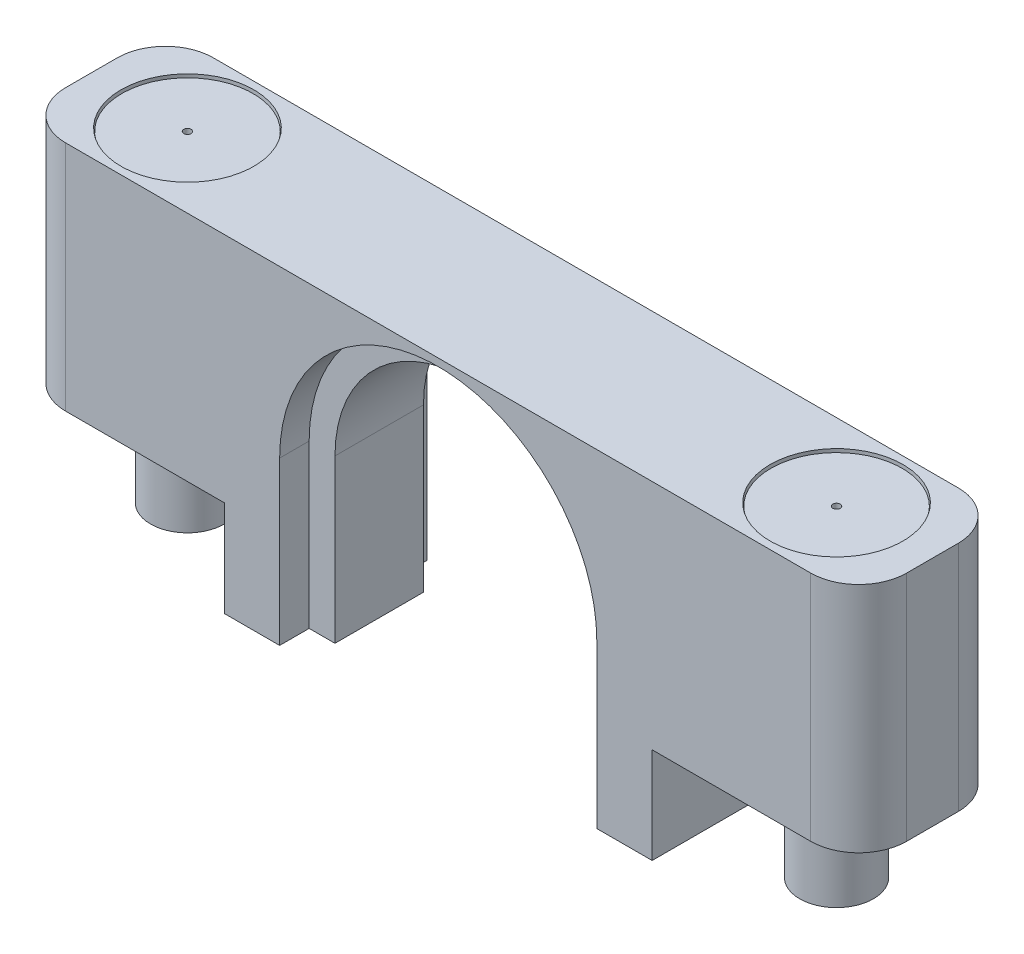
ISO-10303-21;
HEADER;
FILE_DESCRIPTION(('STEP AP214'),'2;1');
FILE_NAME('part.step','',(''),(''),'','','');
FILE_SCHEMA(('AUTOMOTIVE_DESIGN { 1 0 10303 214 1 1 1 1 }'));
ENDSEC;
DATA;
#1=APPLICATION_CONTEXT('core data for automotive mechanical design processes');
#2=APPLICATION_PROTOCOL_DEFINITION('international standard','automotive_design',2000,#1);
#3=PRODUCT_CONTEXT('',#1,'mechanical');
#4=PRODUCT('Part','Part','',(#3));
#5=PRODUCT_RELATED_PRODUCT_CATEGORY('part','',(#4));
#6=PRODUCT_DEFINITION_FORMATION('','',#4);
#7=PRODUCT_DEFINITION_CONTEXT('part definition',#1,'design');
#8=PRODUCT_DEFINITION('design','',#6,#7);
#9=PRODUCT_DEFINITION_SHAPE('','',#8);
#10=(LENGTH_UNIT() NAMED_UNIT(*) SI_UNIT(.MILLI.,.METRE.));
#11=(NAMED_UNIT(*) PLANE_ANGLE_UNIT() SI_UNIT($,.RADIAN.));
#12=(NAMED_UNIT(*) SI_UNIT($,.STERADIAN.) SOLID_ANGLE_UNIT());
#13=UNCERTAINTY_MEASURE_WITH_UNIT(LENGTH_MEASURE(1.E-05),#10,'distance_accuracy_value','');
#14=(GEOMETRIC_REPRESENTATION_CONTEXT(3) GLOBAL_UNCERTAINTY_ASSIGNED_CONTEXT((#13)) GLOBAL_UNIT_ASSIGNED_CONTEXT((#10,
#11,#12)) REPRESENTATION_CONTEXT('',''));
#15=CARTESIAN_POINT('',(0.,0.,0.));
#16=DIRECTION('',(0.,0.,1.));
#17=DIRECTION('',(1.,0.,0.));
#18=AXIS2_PLACEMENT_3D('',#15,#16,#17);
#19=CARTESIAN_POINT('',(-44.,12.55,0.));
#20=DIRECTION('',(0.,1.,0.));
#21=DIRECTION('',(-1.,0.,0.));
#22=AXIS2_PLACEMENT_3D('',#19,#20,#21);
#23=CYLINDRICAL_SURFACE('',#22,9.);
#24=CARTESIAN_POINT('',(-44.,14.3623105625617,0.));
#25=DIRECTION('',(0.,-1.,0.));
#26=DIRECTION('',(0.,0.,-1.));
#27=AXIS2_PLACEMENT_3D('',#24,#25,#26);
#28=CIRCLE('',#27,9.);
#29=CARTESIAN_POINT('',(-44.,14.3623105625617,-9.));
#30=VERTEX_POINT('',#29);
#31=EDGE_CURVE('E574',#30,#30,#28,.T.);
#32=ORIENTED_EDGE('',*,*,#31,.T.);
#33=EDGE_LOOP('',(#32));
#34=FACE_BOUND('',#33,.T.);
#35=CARTESIAN_POINT('',(-44.,15.75,0.));
#36=DIRECTION('',(0.,1.,0.));
#37=DIRECTION('',(-1.,0.,0.));
#38=AXIS2_PLACEMENT_3D('',#35,#36,#37);
#39=CIRCLE('',#38,9.);
#40=CARTESIAN_POINT('',(-53.,15.75,0.));
#41=VERTEX_POINT('',#40);
#42=EDGE_CURVE('E533',#41,#41,#39,.T.);
#43=ORIENTED_EDGE('',*,*,#42,.T.);
#44=EDGE_LOOP('',(#43));
#45=FACE_BOUND('',#44,.T.);
#46=ADVANCED_FACE('F18',(#34,#45),#23,.F.);
#47=CARTESIAN_POINT('',(44.,12.55,0.));
#48=DIRECTION('',(0.,1.,0.));
#49=DIRECTION('',(-1.,0.,0.));
#50=AXIS2_PLACEMENT_3D('',#47,#48,#49);
#51=CYLINDRICAL_SURFACE('',#50,9.);
#52=CARTESIAN_POINT('',(44.,14.3623105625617,0.));
#53=DIRECTION('',(0.,-1.,0.));
#54=DIRECTION('',(0.,0.,-1.));
#55=AXIS2_PLACEMENT_3D('',#52,#53,#54);
#56=CIRCLE('',#55,9.);
#57=CARTESIAN_POINT('',(44.,14.3623105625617,-9.));
#58=VERTEX_POINT('',#57);
#59=EDGE_CURVE('E565',#58,#58,#56,.T.);
#60=ORIENTED_EDGE('',*,*,#59,.T.);
#61=EDGE_LOOP('',(#60));
#62=FACE_BOUND('',#61,.T.);
#63=CARTESIAN_POINT('',(44.,15.75,0.));
#64=DIRECTION('',(0.,1.,0.));
#65=DIRECTION('',(-1.,0.,0.));
#66=AXIS2_PLACEMENT_3D('',#63,#64,#65);
#67=CIRCLE('',#66,9.);
#68=CARTESIAN_POINT('',(35.,15.75,0.));
#69=VERTEX_POINT('',#68);
#70=EDGE_CURVE('E527',#69,#69,#67,.T.);
#71=ORIENTED_EDGE('',*,*,#70,.T.);
#72=EDGE_LOOP('',(#71));
#73=FACE_BOUND('',#72,.T.);
#74=ADVANCED_FACE('F665',(#62,#73),#51,.F.);
#75=CARTESIAN_POINT('',(-57.,15.75,-10.));
#76=DIRECTION('',(0.,1.,0.));
#77=DIRECTION('',(-1.,0.,0.));
#78=AXIS2_PLACEMENT_3D('',#75,#76,#77);
#79=PLANE('',#78);
#80=ORIENTED_EDGE('',*,*,#70,.F.);
#81=EDGE_LOOP('',(#80));
#82=FACE_BOUND('',#81,.T.);
#83=ORIENTED_EDGE('',*,*,#42,.F.);
#84=EDGE_LOOP('',(#83));
#85=FACE_BOUND('',#84,.T.);
#86=DIRECTION('',(1.,0.,0.));
#87=VECTOR('',#86,1.);
#88=CARTESIAN_POINT('',(-57.,15.75,-10.));
#89=LINE('',#88,#87);
#90=CARTESIAN_POINT('',(-50.5,15.75,-10.));
#91=VERTEX_POINT('',#90);
#92=CARTESIAN_POINT('',(50.5,15.75,-10.));
#93=VERTEX_POINT('',#92);
#94=EDGE_CURVE('E560',#91,#93,#89,.T.);
#95=ORIENTED_EDGE('',*,*,#94,.F.);
#96=CARTESIAN_POINT('',(-50.5,15.75,-3.5));
#97=DIRECTION('',(0.,1.,0.));
#98=DIRECTION('',(-1.,0.,0.));
#99=AXIS2_PLACEMENT_3D('',#96,#97,#98);
#100=CIRCLE('',#99,6.5);
#101=CARTESIAN_POINT('',(-57.,15.75,-3.5));
#102=VERTEX_POINT('',#101);
#103=EDGE_CURVE('E542',#91,#102,#100,.T.);
#104=ORIENTED_EDGE('',*,*,#103,.T.);
#105=DIRECTION('',(0.,0.,1.));
#106=VECTOR('',#105,1.);
#107=CARTESIAN_POINT('',(-57.,15.75,-10.));
#108=LINE('',#107,#106);
#109=CARTESIAN_POINT('',(-57.,15.75,3.5));
#110=VERTEX_POINT('',#109);
#111=EDGE_CURVE('E545',#102,#110,#108,.T.);
#112=ORIENTED_EDGE('',*,*,#111,.T.);
#113=CARTESIAN_POINT('',(-50.5,15.75,3.5));
#114=DIRECTION('',(0.,1.,0.));
#115=DIRECTION('',(-1.,0.,0.));
#116=AXIS2_PLACEMENT_3D('',#113,#114,#115);
#117=CIRCLE('',#116,6.5);
#118=CARTESIAN_POINT('',(-50.5,15.75,10.));
#119=VERTEX_POINT('',#118);
#120=EDGE_CURVE('E548',#110,#119,#117,.T.);
#121=ORIENTED_EDGE('',*,*,#120,.T.);
#122=DIRECTION('',(1.,0.,0.));
#123=VECTOR('',#122,1.);
#124=CARTESIAN_POINT('',(-57.,15.75,10.));
#125=LINE('',#124,#123);
#126=CARTESIAN_POINT('',(50.5,15.75,10.));
#127=VERTEX_POINT('',#126);
#128=EDGE_CURVE('E551',#119,#127,#125,.T.);
#129=ORIENTED_EDGE('',*,*,#128,.T.);
#130=CARTESIAN_POINT('',(50.5,15.75,3.5));
#131=DIRECTION('',(0.,1.,0.));
#132=DIRECTION('',(-1.,0.,0.));
#133=AXIS2_PLACEMENT_3D('',#130,#131,#132);
#134=CIRCLE('',#133,6.5);
#135=CARTESIAN_POINT('',(57.,15.75,3.5));
#136=VERTEX_POINT('',#135);
#137=EDGE_CURVE('E554',#127,#136,#134,.T.);
#138=ORIENTED_EDGE('',*,*,#137,.T.);
#139=DIRECTION('',(0.,0.,-1.));
#140=VECTOR('',#139,1.);
#141=CARTESIAN_POINT('',(57.,15.75,-10.));
#142=LINE('',#141,#140);
#143=CARTESIAN_POINT('',(57.,15.75,-3.5));
#144=VERTEX_POINT('',#143);
#145=EDGE_CURVE('E557',#136,#144,#142,.T.);
#146=ORIENTED_EDGE('',*,*,#145,.T.);
#147=CARTESIAN_POINT('',(50.5,15.75,-3.5));
#148=DIRECTION('',(0.,1.,0.));
#149=DIRECTION('',(-1.,0.,0.));
#150=AXIS2_PLACEMENT_3D('',#147,#148,#149);
#151=CIRCLE('',#150,6.5);
#152=EDGE_CURVE('E34',#144,#93,#151,.T.);
#153=ORIENTED_EDGE('',*,*,#152,.T.);
#154=EDGE_LOOP('',(#95,#104,#112,#121,#129,#138,#146,#153));
#155=FACE_BOUND('',#154,.T.);
#156=ADVANCED_FACE('F672',(#82,#85,#155),#79,.T.);
#157=CARTESIAN_POINT('',(0.,-28.75,0.));
#158=DIRECTION('',(0.,-1.,0.));
#159=DIRECTION('',(1.,0.,0.));
#160=AXIS2_PLACEMENT_3D('',#157,#158,#159);
#161=PLANE('',#160);
#162=DIRECTION('',(-1.,0.,0.));
#163=VECTOR('',#162,1.);
#164=CARTESIAN_POINT('',(0.,-28.75,-10.));
#165=LINE('',#164,#163);
#166=CARTESIAN_POINT('',(29.,-28.75,-10.));
#167=VERTEX_POINT('',#166);
#168=CARTESIAN_POINT('',(21.5,-28.75,-10.));
#169=VERTEX_POINT('',#168);
#170=EDGE_CURVE('E497',#167,#169,#165,.T.);
#171=ORIENTED_EDGE('',*,*,#170,.F.);
#172=DIRECTION('',(0.,0.,-1.));
#173=VECTOR('',#172,1.);
#174=CARTESIAN_POINT('',(29.,-28.75,0.));
#175=LINE('',#174,#173);
#176=CARTESIAN_POINT('',(29.,-28.75,10.));
#177=VERTEX_POINT('',#176);
#178=EDGE_CURVE('E488',#177,#167,#175,.T.);
#179=ORIENTED_EDGE('',*,*,#178,.F.);
#180=DIRECTION('',(-1.,0.,0.));
#181=VECTOR('',#180,1.);
#182=CARTESIAN_POINT('',(0.,-28.75,10.));
#183=LINE('',#182,#181);
#184=CARTESIAN_POINT('',(21.5,-28.75,10.));
#185=VERTEX_POINT('',#184);
#186=EDGE_CURVE('E490',#177,#185,#183,.T.);
#187=ORIENTED_EDGE('',*,*,#186,.T.);
#188=DIRECTION('',(0.,0.,1.));
#189=VECTOR('',#188,1.);
#190=CARTESIAN_POINT('',(21.5,-28.75,0.));
#191=LINE('',#190,#189);
#192=CARTESIAN_POINT('',(21.5,-28.75,6.));
#193=VERTEX_POINT('',#192);
#194=EDGE_CURVE('E493',#193,#185,#191,.T.);
#195=ORIENTED_EDGE('',*,*,#194,.F.);
#196=DIRECTION('',(-1.,0.,0.));
#197=VECTOR('',#196,1.);
#198=CARTESIAN_POINT('',(0.,-28.75,6.));
#199=LINE('',#198,#197);
#200=CARTESIAN_POINT('',(18.,-28.75,6.));
#201=VERTEX_POINT('',#200);
#202=EDGE_CURVE('E495',#193,#201,#199,.T.);
#203=ORIENTED_EDGE('',*,*,#202,.T.);
#204=DIRECTION('',(0.,0.,1.));
#205=VECTOR('',#204,1.);
#206=CARTESIAN_POINT('',(18.,-28.75,0.));
#207=LINE('',#206,#205);
#208=CARTESIAN_POINT('',(18.,-28.75,-6.));
#209=VERTEX_POINT('',#208);
#210=EDGE_CURVE('E480',#209,#201,#207,.T.);
#211=ORIENTED_EDGE('',*,*,#210,.F.);
#212=DIRECTION('',(1.,0.,0.));
#213=VECTOR('',#212,1.);
#214=CARTESIAN_POINT('',(0.,-28.75,-6.));
#215=LINE('',#214,#213);
#216=CARTESIAN_POINT('',(21.5,-28.75,-6.));
#217=VERTEX_POINT('',#216);
#218=EDGE_CURVE('E483',#209,#217,#215,.T.);
#219=ORIENTED_EDGE('',*,*,#218,.T.);
#220=DIRECTION('',(0.,0.,1.));
#221=VECTOR('',#220,1.);
#222=CARTESIAN_POINT('',(21.5,-28.75,0.));
#223=LINE('',#222,#221);
#224=EDGE_CURVE('E486',#169,#217,#223,.T.);
#225=ORIENTED_EDGE('',*,*,#224,.F.);
#226=EDGE_LOOP('',(#171,#179,#187,#195,#203,#211,#219,#225));
#227=FACE_BOUND('',#226,.T.);
#228=ADVANCED_FACE('F742',(#227),#161,.T.);
#229=CARTESIAN_POINT('',(0.,-32.7022472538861,6.));
#230=DIRECTION('',(0.,0.,1.));
#231=DIRECTION('',(1.,0.,0.));
#232=AXIS2_PLACEMENT_3D('',#229,#230,#231);
#233=PLANE('',#232);
#234=ORIENTED_EDGE('',*,*,#202,.F.);
#235=DIRECTION('',(0.,1.,0.));
#236=VECTOR('',#235,1.);
#237=CARTESIAN_POINT('',(21.5,-32.7022472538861,6.));
#238=LINE('',#237,#236);
#239=CARTESIAN_POINT('',(21.5,-6.75,6.));
#240=VERTEX_POINT('',#239);
#241=EDGE_CURVE('E377',#193,#240,#238,.T.);
#242=ORIENTED_EDGE('',*,*,#241,.T.);
#243=CARTESIAN_POINT('',(0.,-6.75,6.));
#244=DIRECTION('',(0.,0.,1.));
#245=DIRECTION('',(1.,0.,0.));
#246=AXIS2_PLACEMENT_3D('',#243,#244,#245);
#247=CIRCLE('',#246,21.5);
#248=CARTESIAN_POINT('',(-21.5,-6.75,6.));
#249=VERTEX_POINT('',#248);
#250=EDGE_CURVE('E369',#240,#249,#247,.T.);
#251=ORIENTED_EDGE('',*,*,#250,.T.);
#252=DIRECTION('',(0.,1.,0.));
#253=VECTOR('',#252,1.);
#254=CARTESIAN_POINT('',(-21.5,-32.7022472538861,6.));
#255=LINE('',#254,#253);
#256=CARTESIAN_POINT('',(-21.5,-28.75,6.));
#257=VERTEX_POINT('',#256);
#258=EDGE_CURVE('E392',#249,#257,#255,.F.);
#259=ORIENTED_EDGE('',*,*,#258,.T.);
#260=DIRECTION('',(-1.,0.,0.));
#261=VECTOR('',#260,1.);
#262=CARTESIAN_POINT('',(0.,-28.75,6.));
#263=LINE('',#262,#261);
#264=CARTESIAN_POINT('',(-18.,-28.75,6.));
#265=VERTEX_POINT('',#264);
#266=EDGE_CURVE('E468',#265,#257,#263,.T.);
#267=ORIENTED_EDGE('',*,*,#266,.F.);
#268=DIRECTION('',(0.,1.,0.));
#269=VECTOR('',#268,1.);
#270=CARTESIAN_POINT('',(-18.,-68.4288739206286,6.));
#271=LINE('',#270,#269);
#272=CARTESIAN_POINT('',(-18.,-6.75,6.));
#273=VERTEX_POINT('',#272);
#274=EDGE_CURVE('E421',#265,#273,#271,.T.);
#275=ORIENTED_EDGE('',*,*,#274,.T.);
#276=CARTESIAN_POINT('',(0.,-6.75,6.));
#277=DIRECTION('',(0.,0.,1.));
#278=DIRECTION('',(1.,0.,0.));
#279=AXIS2_PLACEMENT_3D('',#276,#277,#278);
#280=CIRCLE('',#279,18.);
#281=CARTESIAN_POINT('',(18.,-6.75,6.));
#282=VERTEX_POINT('',#281);
#283=EDGE_CURVE('E423',#273,#282,#280,.F.);
#284=ORIENTED_EDGE('',*,*,#283,.T.);
#285=DIRECTION('',(0.,1.,0.));
#286=VECTOR('',#285,1.);
#287=CARTESIAN_POINT('',(18.,-32.7022472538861,6.));
#288=LINE('',#287,#286);
#289=EDGE_CURVE('E350',#201,#282,#288,.T.);
#290=ORIENTED_EDGE('',*,*,#289,.F.);
#291=EDGE_LOOP('',(#234,#242,#251,#259,#267,#275,#284,#290));
#292=FACE_BOUND('',#291,.T.);
#293=ADVANCED_FACE('F730',(#292),#233,.T.);
#294=CARTESIAN_POINT('',(21.5,-33.5295457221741,-6.));
#295=DIRECTION('',(1.,0.,0.));
#296=DIRECTION('',(0.,0.,-1.));
#297=AXIS2_PLACEMENT_3D('',#294,#295,#296);
#298=PLANE('',#297);
#299=DIRECTION('',(0.,-1.,0.));
#300=VECTOR('',#299,1.);
#301=CARTESIAN_POINT('',(21.5,-33.5295457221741,-10.));
#302=LINE('',#301,#300);
#303=CARTESIAN_POINT('',(21.5,-6.75,-10.));
#304=VERTEX_POINT('',#303);
#305=EDGE_CURVE('E428',#169,#304,#302,.F.);
#306=ORIENTED_EDGE('',*,*,#305,.F.);
#307=ORIENTED_EDGE('',*,*,#224,.T.);
#308=DIRECTION('',(0.,1.,0.));
#309=VECTOR('',#308,1.);
#310=CARTESIAN_POINT('',(21.5,-33.5295457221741,-6.));
#311=LINE('',#310,#309);
#312=CARTESIAN_POINT('',(21.5,-6.75,-6.));
#313=VERTEX_POINT('',#312);
#314=EDGE_CURVE('E397',#313,#217,#311,.F.);
#315=ORIENTED_EDGE('',*,*,#314,.F.);
#316=DIRECTION('',(0.,0.,-1.));
#317=VECTOR('',#316,1.);
#318=CARTESIAN_POINT('',(21.5,-6.75,-6.));
#319=LINE('',#318,#317);
#320=EDGE_CURVE('E384',#313,#304,#319,.T.);
#321=ORIENTED_EDGE('',*,*,#320,.T.);
#322=EDGE_LOOP('',(#306,#307,#315,#321));
#323=FACE_BOUND('',#322,.T.);
#324=ADVANCED_FACE('F726',(#323),#298,.F.);
#325=CARTESIAN_POINT('',(0.,-33.5295457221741,-6.));
#326=DIRECTION('',(0.,0.,-1.));
#327=DIRECTION('',(-1.,0.,0.));
#328=AXIS2_PLACEMENT_3D('',#325,#326,#327);
#329=PLANE('',#328);
#330=ORIENTED_EDGE('',*,*,#218,.F.);
#331=DIRECTION('',(0.,1.,0.));
#332=VECTOR('',#331,1.);
#333=CARTESIAN_POINT('',(18.,-68.4288739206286,-6.));
#334=LINE('',#333,#332);
#335=CARTESIAN_POINT('',(18.,-6.75,-6.));
#336=VERTEX_POINT('',#335);
#337=EDGE_CURVE('E435',#209,#336,#334,.T.);
#338=ORIENTED_EDGE('',*,*,#337,.T.);
#339=CARTESIAN_POINT('',(0.,-6.75,-6.));
#340=DIRECTION('',(0.,0.,-1.));
#341=DIRECTION('',(-1.,0.,0.));
#342=AXIS2_PLACEMENT_3D('',#339,#340,#341);
#343=CIRCLE('',#342,18.);
#344=CARTESIAN_POINT('',(-18.,-6.75,-6.));
#345=VERTEX_POINT('',#344);
#346=EDGE_CURVE('E437',#345,#336,#343,.T.);
#347=ORIENTED_EDGE('',*,*,#346,.F.);
#348=DIRECTION('',(0.,1.,0.));
#349=VECTOR('',#348,1.);
#350=CARTESIAN_POINT('',(-18.,-33.5295457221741,-6.));
#351=LINE('',#350,#349);
#352=CARTESIAN_POINT('',(-18.,-28.75,-6.));
#353=VERTEX_POINT('',#352);
#354=EDGE_CURVE('E433',#353,#345,#351,.T.);
#355=ORIENTED_EDGE('',*,*,#354,.F.);
#356=DIRECTION('',(1.,0.,0.));
#357=VECTOR('',#356,1.);
#358=CARTESIAN_POINT('',(0.,-28.75,-6.));
#359=LINE('',#358,#357);
#360=CARTESIAN_POINT('',(-21.5,-28.75,-6.));
#361=VERTEX_POINT('',#360);
#362=EDGE_CURVE('E459',#361,#353,#359,.T.);
#363=ORIENTED_EDGE('',*,*,#362,.F.);
#364=DIRECTION('',(0.,1.,0.));
#365=VECTOR('',#364,1.);
#366=CARTESIAN_POINT('',(-21.5,-33.5295457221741,-6.));
#367=LINE('',#366,#365);
#368=CARTESIAN_POINT('',(-21.5,-6.75,-6.));
#369=VERTEX_POINT('',#368);
#370=EDGE_CURVE('E395',#361,#369,#367,.T.);
#371=ORIENTED_EDGE('',*,*,#370,.T.);
#372=CARTESIAN_POINT('',(0.,-6.75,-6.));
#373=DIRECTION('',(0.,0.,-1.));
#374=DIRECTION('',(-1.,0.,0.));
#375=AXIS2_PLACEMENT_3D('',#372,#373,#374);
#376=CIRCLE('',#375,21.5);
#377=EDGE_CURVE('E388',#369,#313,#376,.T.);
#378=ORIENTED_EDGE('',*,*,#377,.T.);
#379=ORIENTED_EDGE('',*,*,#314,.T.);
#380=EDGE_LOOP('',(#330,#338,#347,#355,#363,#371,#378,#379));
#381=FACE_BOUND('',#380,.T.);
#382=ADVANCED_FACE('F729',(#381),#329,.T.);
#383=CARTESIAN_POINT('',(18.,-68.4288739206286,10.));
#384=DIRECTION('',(1.,0.,0.));
#385=DIRECTION('',(0.,0.,-1.));
#386=AXIS2_PLACEMENT_3D('',#383,#384,#385);
#387=PLANE('',#386);
#388=ORIENTED_EDGE('',*,*,#337,.F.);
#389=ORIENTED_EDGE('',*,*,#210,.T.);
#390=ORIENTED_EDGE('',*,*,#289,.T.);
#391=DIRECTION('',(0.,0.,-1.));
#392=VECTOR('',#391,1.);
#393=CARTESIAN_POINT('',(18.,-6.75,10.));
#394=LINE('',#393,#392);
#395=EDGE_CURVE('E347',#336,#282,#394,.F.);
#396=ORIENTED_EDGE('',*,*,#395,.F.);
#397=EDGE_LOOP('',(#388,#389,#390,#396));
#398=FACE_BOUND('',#397,.T.);
#399=ADVANCED_FACE('F734',(#398),#387,.F.);
#400=CARTESIAN_POINT('',(0.,-28.75,0.));
#401=DIRECTION('',(0.,-1.,0.));
#402=DIRECTION('',(1.,0.,0.));
#403=AXIS2_PLACEMENT_3D('',#400,#401,#402);
#404=PLANE('',#403);
#405=DIRECTION('',(0.,0.,1.));
#406=VECTOR('',#405,1.);
#407=CARTESIAN_POINT('',(-29.,-28.75,0.));
#408=LINE('',#407,#406);
#409=CARTESIAN_POINT('',(-29.,-28.75,-10.));
#410=VERTEX_POINT('',#409);
#411=CARTESIAN_POINT('',(-29.,-28.75,10.));
#412=VERTEX_POINT('',#411);
#413=EDGE_CURVE('E478',#410,#412,#408,.T.);
#414=ORIENTED_EDGE('',*,*,#413,.F.);
#415=DIRECTION('',(-1.,0.,0.));
#416=VECTOR('',#415,1.);
#417=CARTESIAN_POINT('',(0.,-28.75,-10.));
#418=LINE('',#417,#416);
#419=CARTESIAN_POINT('',(-21.5,-28.75,-10.));
#420=VERTEX_POINT('',#419);
#421=EDGE_CURVE('E462',#420,#410,#418,.T.);
#422=ORIENTED_EDGE('',*,*,#421,.F.);
#423=DIRECTION('',(0.,0.,-1.));
#424=VECTOR('',#423,1.);
#425=CARTESIAN_POINT('',(-21.5,-28.75,0.));
#426=LINE('',#425,#424);
#427=EDGE_CURVE('E471',#361,#420,#426,.T.);
#428=ORIENTED_EDGE('',*,*,#427,.F.);
#429=ORIENTED_EDGE('',*,*,#362,.T.);
#430=DIRECTION('',(0.,0.,-1.));
#431=VECTOR('',#430,1.);
#432=CARTESIAN_POINT('',(-18.,-28.75,0.));
#433=LINE('',#432,#431);
#434=EDGE_CURVE('E474',#265,#353,#433,.T.);
#435=ORIENTED_EDGE('',*,*,#434,.F.);
#436=ORIENTED_EDGE('',*,*,#266,.T.);
#437=DIRECTION('',(0.,0.,-1.));
#438=VECTOR('',#437,1.);
#439=CARTESIAN_POINT('',(-21.5,-28.75,0.));
#440=LINE('',#439,#438);
#441=CARTESIAN_POINT('',(-21.5,-28.75,10.));
#442=VERTEX_POINT('',#441);
#443=EDGE_CURVE('E476',#442,#257,#440,.T.);
#444=ORIENTED_EDGE('',*,*,#443,.F.);
#445=DIRECTION('',(-1.,0.,0.));
#446=VECTOR('',#445,1.);
#447=CARTESIAN_POINT('',(0.,-28.75,10.));
#448=LINE('',#447,#446);
#449=EDGE_CURVE('E465',#442,#412,#448,.T.);
#450=ORIENTED_EDGE('',*,*,#449,.T.);
#451=EDGE_LOOP('',(#414,#422,#428,#429,#435,#436,#444,#450));
#452=FACE_BOUND('',#451,.T.);
#453=ADVANCED_FACE('F738',(#452),#404,.T.);
#454=CARTESIAN_POINT('',(0.,0.,-10.));
#455=DIRECTION('',(0.,0.,1.));
#456=DIRECTION('',(1.,0.,0.));
#457=AXIS2_PLACEMENT_3D('',#454,#455,#456);
#458=PLANE('',#457);
#459=DIRECTION('',(0.,1.,0.));
#460=VECTOR('',#459,1.);
#461=CARTESIAN_POINT('',(-50.5,0.,-10.));
#462=LINE('',#461,#460);
#463=CARTESIAN_POINT('',(-50.5,-15.75,-10.));
#464=VERTEX_POINT('',#463);
#465=EDGE_CURVE('E355',#91,#464,#462,.F.);
#466=ORIENTED_EDGE('',*,*,#465,.F.);
#467=ORIENTED_EDGE('',*,*,#94,.T.);
#468=DIRECTION('',(0.,1.,0.));
#469=VECTOR('',#468,1.);
#470=CARTESIAN_POINT('',(50.5,0.,-10.));
#471=LINE('',#470,#469);
#472=CARTESIAN_POINT('',(50.5,-15.75,-10.));
#473=VERTEX_POINT('',#472);
#474=EDGE_CURVE('E357',#473,#93,#471,.T.);
#475=ORIENTED_EDGE('',*,*,#474,.F.);
#476=DIRECTION('',(1.,0.,0.));
#477=VECTOR('',#476,1.);
#478=CARTESIAN_POINT('',(0.,-15.75,-10.));
#479=LINE('',#478,#477);
#480=CARTESIAN_POINT('',(29.,-15.75,-10.));
#481=VERTEX_POINT('',#480);
#482=EDGE_CURVE('E523',#481,#473,#479,.T.);
#483=ORIENTED_EDGE('',*,*,#482,.F.);
#484=DIRECTION('',(0.,1.,0.));
#485=VECTOR('',#484,1.);
#486=CARTESIAN_POINT('',(29.,-28.75,-10.));
#487=LINE('',#486,#485);
#488=EDGE_CURVE('E440',#481,#167,#487,.F.);
#489=ORIENTED_EDGE('',*,*,#488,.T.);
#490=ORIENTED_EDGE('',*,*,#170,.T.);
#491=ORIENTED_EDGE('',*,*,#305,.T.);
#492=CARTESIAN_POINT('',(0.,-6.75,-10.));
#493=DIRECTION('',(0.,0.,1.));
#494=DIRECTION('',(1.,0.,0.));
#495=AXIS2_PLACEMENT_3D('',#492,#493,#494);
#496=CIRCLE('',#495,21.5);
#497=CARTESIAN_POINT('',(-21.5,-6.75,-10.));
#498=VERTEX_POINT('',#497);
#499=EDGE_CURVE('E430',#498,#304,#496,.F.);
#500=ORIENTED_EDGE('',*,*,#499,.F.);
#501=DIRECTION('',(0.,-1.,0.));
#502=VECTOR('',#501,1.);
#503=CARTESIAN_POINT('',(-21.5,0.,-10.));
#504=LINE('',#503,#502);
#505=EDGE_CURVE('E426',#420,#498,#504,.F.);
#506=ORIENTED_EDGE('',*,*,#505,.F.);
#507=ORIENTED_EDGE('',*,*,#421,.T.);
#508=DIRECTION('',(0.,1.,0.));
#509=VECTOR('',#508,1.);
#510=CARTESIAN_POINT('',(-29.,0.,-10.));
#511=LINE('',#510,#509);
#512=CARTESIAN_POINT('',(-29.,-15.75,-10.));
#513=VERTEX_POINT('',#512);
#514=EDGE_CURVE('E446',#513,#410,#511,.F.);
#515=ORIENTED_EDGE('',*,*,#514,.F.);
#516=DIRECTION('',(-1.,0.,0.));
#517=VECTOR('',#516,1.);
#518=CARTESIAN_POINT('',(-57.,-15.75,-10.));
#519=LINE('',#518,#517);
#520=EDGE_CURVE('E499',#513,#464,#519,.T.);
#521=ORIENTED_EDGE('',*,*,#520,.T.);
#522=EDGE_LOOP('',(#466,#467,#475,#483,#489,#490,#491,#500,#506,#507,#515,#521));
#523=FACE_BOUND('',#522,.T.);
#524=ADVANCED_FACE('F766',(#523),#458,.F.);
#525=CARTESIAN_POINT('',(0.,-6.75,10.));
#526=DIRECTION('',(0.,0.,-1.));
#527=DIRECTION('',(-1.,0.,0.));
#528=AXIS2_PLACEMENT_3D('',#525,#526,#527);
#529=CYLINDRICAL_SURFACE('',#528,18.);
#530=DIRECTION('',(0.,0.,1.));
#531=VECTOR('',#530,1.);
#532=CARTESIAN_POINT('',(-18.,-6.75,10.));
#533=LINE('',#532,#531);
#534=EDGE_CURVE('E401',#273,#345,#533,.F.);
#535=ORIENTED_EDGE('',*,*,#534,.T.);
#536=ORIENTED_EDGE('',*,*,#346,.T.);
#537=ORIENTED_EDGE('',*,*,#395,.T.);
#538=ORIENTED_EDGE('',*,*,#283,.F.);
#539=EDGE_LOOP('',(#535,#536,#537,#538));
#540=FACE_BOUND('',#539,.T.);
#541=ADVANCED_FACE('F713',(#540),#529,.F.);
#542=CARTESIAN_POINT('',(-18.,-68.4288739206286,10.));
#543=DIRECTION('',(-1.,0.,0.));
#544=DIRECTION('',(0.,0.,1.));
#545=AXIS2_PLACEMENT_3D('',#542,#543,#544);
#546=PLANE('',#545);
#547=ORIENTED_EDGE('',*,*,#274,.F.);
#548=ORIENTED_EDGE('',*,*,#434,.T.);
#549=ORIENTED_EDGE('',*,*,#354,.T.);
#550=ORIENTED_EDGE('',*,*,#534,.F.);
#551=EDGE_LOOP('',(#547,#548,#549,#550));
#552=FACE_BOUND('',#551,.T.);
#553=ADVANCED_FACE('F751',(#552),#546,.F.);
#554=CARTESIAN_POINT('',(-21.5,-33.5295457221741,-6.));
#555=DIRECTION('',(-1.,0.,0.));
#556=DIRECTION('',(0.,0.,1.));
#557=AXIS2_PLACEMENT_3D('',#554,#555,#556);
#558=PLANE('',#557);
#559=ORIENTED_EDGE('',*,*,#370,.F.);
#560=ORIENTED_EDGE('',*,*,#427,.T.);
#561=ORIENTED_EDGE('',*,*,#505,.T.);
#562=DIRECTION('',(0.,0.,-1.));
#563=VECTOR('',#562,1.);
#564=CARTESIAN_POINT('',(-21.5,-6.75,-6.));
#565=LINE('',#564,#563);
#566=EDGE_CURVE('E387',#498,#369,#565,.F.);
#567=ORIENTED_EDGE('',*,*,#566,.T.);
#568=EDGE_LOOP('',(#559,#560,#561,#567));
#569=FACE_BOUND('',#568,.T.);
#570=ADVANCED_FACE('F754',(#569),#558,.F.);
#571=CARTESIAN_POINT('',(0.,-6.75,-6.));
#572=DIRECTION('',(0.,0.,-1.));
#573=DIRECTION('',(-1.,0.,0.));
#574=AXIS2_PLACEMENT_3D('',#571,#572,#573);
#575=CYLINDRICAL_SURFACE('',#574,21.5);
#576=ORIENTED_EDGE('',*,*,#566,.F.);
#577=ORIENTED_EDGE('',*,*,#499,.T.);
#578=ORIENTED_EDGE('',*,*,#320,.F.);
#579=ORIENTED_EDGE('',*,*,#377,.F.);
#580=EDGE_LOOP('',(#576,#577,#578,#579));
#581=FACE_BOUND('',#580,.T.);
#582=ADVANCED_FACE('F724',(#581),#575,.F.);
#583=CARTESIAN_POINT('',(29.,-28.75,10.));
#584=DIRECTION('',(-1.,0.,0.));
#585=DIRECTION('',(0.,0.,1.));
#586=AXIS2_PLACEMENT_3D('',#583,#584,#585);
#587=PLANE('',#586);
#588=DIRECTION('',(0.,-1.,0.));
#589=VECTOR('',#588,1.);
#590=CARTESIAN_POINT('',(29.,0.,10.));
#591=LINE('',#590,#589);
#592=CARTESIAN_POINT('',(29.,-15.75,10.));
#593=VERTEX_POINT('',#592);
#594=EDGE_CURVE('E443',#593,#177,#591,.T.);
#595=ORIENTED_EDGE('',*,*,#594,.T.);
#596=ORIENTED_EDGE('',*,*,#178,.T.);
#597=ORIENTED_EDGE('',*,*,#488,.F.);
#598=DIRECTION('',(0.,0.,1.));
#599=VECTOR('',#598,1.);
#600=CARTESIAN_POINT('',(29.,-15.75,-10.));
#601=LINE('',#600,#599);
#602=EDGE_CURVE('E375',#593,#481,#601,.F.);
#603=ORIENTED_EDGE('',*,*,#602,.F.);
#604=EDGE_LOOP('',(#595,#596,#597,#603));
#605=FACE_BOUND('',#604,.T.);
#606=ADVANCED_FACE('F720',(#605),#587,.F.);
#607=CARTESIAN_POINT('',(-57.,-15.75,-10.));
#608=DIRECTION('',(0.,-1.,0.));
#609=DIRECTION('',(1.,0.,0.));
#610=AXIS2_PLACEMENT_3D('',#607,#608,#609);
#611=PLANE('',#610);
#612=CARTESIAN_POINT('',(44.,-15.75,0.));
#613=DIRECTION('',(0.,-1.,0.));
#614=DIRECTION('',(1.,0.,0.));
#615=AXIS2_PLACEMENT_3D('',#612,#613,#614);
#616=CIRCLE('',#615,5.5);
#617=CARTESIAN_POINT('',(49.5,-15.75,0.));
#618=VERTEX_POINT('',#617);
#619=EDGE_CURVE('E539',#618,#618,#616,.T.);
#620=ORIENTED_EDGE('',*,*,#619,.F.);
#621=EDGE_LOOP('',(#620));
#622=FACE_BOUND('',#621,.T.);
#623=DIRECTION('',(-1.,0.,0.));
#624=VECTOR('',#623,1.);
#625=CARTESIAN_POINT('',(-57.,-15.75,10.));
#626=LINE('',#625,#624);
#627=CARTESIAN_POINT('',(50.5,-15.75,10.));
#628=VERTEX_POINT('',#627);
#629=EDGE_CURVE('E514',#593,#628,#626,.F.);
#630=ORIENTED_EDGE('',*,*,#629,.F.);
#631=ORIENTED_EDGE('',*,*,#602,.T.);
#632=ORIENTED_EDGE('',*,*,#482,.T.);
#633=CARTESIAN_POINT('',(50.5,-15.75,-3.5));
#634=DIRECTION('',(0.,-1.,0.));
#635=DIRECTION('',(1.,0.,0.));
#636=AXIS2_PLACEMENT_3D('',#633,#634,#635);
#637=CIRCLE('',#636,6.5);
#638=CARTESIAN_POINT('',(57.,-15.75,-3.5));
#639=VERTEX_POINT('',#638);
#640=EDGE_CURVE('E524',#639,#473,#637,.F.);
#641=ORIENTED_EDGE('',*,*,#640,.F.);
#642=DIRECTION('',(0.,0.,1.));
#643=VECTOR('',#642,1.);
#644=CARTESIAN_POINT('',(57.,-15.75,-10.));
#645=LINE('',#644,#643);
#646=CARTESIAN_POINT('',(57.,-15.75,3.5));
#647=VERTEX_POINT('',#646);
#648=EDGE_CURVE('E520',#647,#639,#645,.F.);
#649=ORIENTED_EDGE('',*,*,#648,.F.);
#650=CARTESIAN_POINT('',(50.5,-15.75,3.5));
#651=DIRECTION('',(0.,-1.,0.));
#652=DIRECTION('',(1.,0.,0.));
#653=AXIS2_PLACEMENT_3D('',#650,#651,#652);
#654=CIRCLE('',#653,6.5);
#655=EDGE_CURVE('E517',#628,#647,#654,.F.);
#656=ORIENTED_EDGE('',*,*,#655,.F.);
#657=EDGE_LOOP('',(#630,#631,#632,#641,#649,#656));
#658=FACE_BOUND('',#657,.T.);
#659=ADVANCED_FACE('F723',(#622,#658),#611,.T.);
#660=CARTESIAN_POINT('',(57.,15.75,-10.));
#661=DIRECTION('',(1.,0.,0.));
#662=DIRECTION('',(0.,1.,0.));
#663=AXIS2_PLACEMENT_3D('',#660,#661,#662);
#664=PLANE('',#663);
#665=ORIENTED_EDGE('',*,*,#145,.F.);
#666=DIRECTION('',(0.,1.,0.));
#667=VECTOR('',#666,1.);
#668=CARTESIAN_POINT('',(57.,0.,3.5));
#669=LINE('',#668,#667);
#670=EDGE_CURVE('E365',#647,#136,#669,.T.);
#671=ORIENTED_EDGE('',*,*,#670,.F.);
#672=ORIENTED_EDGE('',*,*,#648,.T.);
#673=DIRECTION('',(0.,-1.,0.));
#674=VECTOR('',#673,1.);
#675=CARTESIAN_POINT('',(57.,15.75,-3.5));
#676=LINE('',#675,#674);
#677=EDGE_CURVE('E379',#144,#639,#676,.T.);
#678=ORIENTED_EDGE('',*,*,#677,.F.);
#679=EDGE_LOOP('',(#665,#671,#672,#678));
#680=FACE_BOUND('',#679,.T.);
#681=ADVANCED_FACE('F718',(#680),#664,.T.);
#682=CARTESIAN_POINT('',(21.5,-32.7022472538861,6.));
#683=DIRECTION('',(1.,0.,0.));
#684=DIRECTION('',(0.,0.,-1.));
#685=AXIS2_PLACEMENT_3D('',#682,#683,#684);
#686=PLANE('',#685);
#687=ORIENTED_EDGE('',*,*,#241,.F.);
#688=ORIENTED_EDGE('',*,*,#194,.T.);
#689=DIRECTION('',(0.,1.,0.));
#690=VECTOR('',#689,1.);
#691=CARTESIAN_POINT('',(21.5,0.,10.));
#692=LINE('',#691,#690);
#693=CARTESIAN_POINT('',(21.5,-6.75,10.));
#694=VERTEX_POINT('',#693);
#695=EDGE_CURVE('E452',#185,#694,#692,.T.);
#696=ORIENTED_EDGE('',*,*,#695,.T.);
#697=DIRECTION('',(0.,0.,1.));
#698=VECTOR('',#697,1.);
#699=CARTESIAN_POINT('',(21.5,-6.75,6.));
#700=LINE('',#699,#698);
#701=EDGE_CURVE('E361',#694,#240,#700,.F.);
#702=ORIENTED_EDGE('',*,*,#701,.T.);
#703=EDGE_LOOP('',(#687,#688,#696,#702));
#704=FACE_BOUND('',#703,.T.);
#705=ADVANCED_FACE('F714',(#704),#686,.F.);
#706=CARTESIAN_POINT('',(-21.5,-32.7022472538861,6.));
#707=DIRECTION('',(-1.,0.,0.));
#708=DIRECTION('',(0.,0.,1.));
#709=AXIS2_PLACEMENT_3D('',#706,#707,#708);
#710=PLANE('',#709);
#711=DIRECTION('',(0.,1.,0.));
#712=VECTOR('',#711,1.);
#713=CARTESIAN_POINT('',(-21.5,-32.7022472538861,10.));
#714=LINE('',#713,#712);
#715=CARTESIAN_POINT('',(-21.5,-6.75,10.));
#716=VERTEX_POINT('',#715);
#717=EDGE_CURVE('E454',#442,#716,#714,.T.);
#718=ORIENTED_EDGE('',*,*,#717,.F.);
#719=ORIENTED_EDGE('',*,*,#443,.T.);
#720=ORIENTED_EDGE('',*,*,#258,.F.);
#721=DIRECTION('',(0.,0.,1.));
#722=VECTOR('',#721,1.);
#723=CARTESIAN_POINT('',(-21.5,-6.75,6.));
#724=LINE('',#723,#722);
#725=EDGE_CURVE('E366',#249,#716,#724,.T.);
#726=ORIENTED_EDGE('',*,*,#725,.T.);
#727=EDGE_LOOP('',(#718,#719,#720,#726));
#728=FACE_BOUND('',#727,.T.);
#729=ADVANCED_FACE('F717',(#728),#710,.F.);
#730=CARTESIAN_POINT('',(0.,-6.75,6.));
#731=DIRECTION('',(0.,0.,1.));
#732=DIRECTION('',(1.,0.,0.));
#733=AXIS2_PLACEMENT_3D('',#730,#731,#732);
#734=CYLINDRICAL_SURFACE('',#733,21.5);
#735=ORIENTED_EDGE('',*,*,#701,.F.);
#736=CARTESIAN_POINT('',(0.,-6.75,10.));
#737=DIRECTION('',(0.,0.,1.));
#738=DIRECTION('',(1.,0.,0.));
#739=AXIS2_PLACEMENT_3D('',#736,#737,#738);
#740=CIRCLE('',#739,21.5);
#741=EDGE_CURVE('E456',#716,#694,#740,.F.);
#742=ORIENTED_EDGE('',*,*,#741,.F.);
#743=ORIENTED_EDGE('',*,*,#725,.F.);
#744=ORIENTED_EDGE('',*,*,#250,.F.);
#745=EDGE_LOOP('',(#735,#742,#743,#744));
#746=FACE_BOUND('',#745,.T.);
#747=ADVANCED_FACE('F749',(#746),#734,.F.);
#748=CARTESIAN_POINT('',(-57.,15.75,-10.));
#749=DIRECTION('',(-1.,0.,0.));
#750=DIRECTION('',(0.,-1.,0.));
#751=AXIS2_PLACEMENT_3D('',#748,#749,#750);
#752=PLANE('',#751);
#753=ORIENTED_EDGE('',*,*,#111,.F.);
#754=DIRECTION('',(0.,1.,0.));
#755=VECTOR('',#754,1.);
#756=CARTESIAN_POINT('',(-57.,15.75,-3.5));
#757=LINE('',#756,#755);
#758=CARTESIAN_POINT('',(-57.,-15.75,-3.5));
#759=VERTEX_POINT('',#758);
#760=EDGE_CURVE('E381',#759,#102,#757,.T.);
#761=ORIENTED_EDGE('',*,*,#760,.F.);
#762=DIRECTION('',(0.,0.,1.));
#763=VECTOR('',#762,1.);
#764=CARTESIAN_POINT('',(-57.,-15.75,-10.));
#765=LINE('',#764,#763);
#766=CARTESIAN_POINT('',(-57.,-15.75,3.5));
#767=VERTEX_POINT('',#766);
#768=EDGE_CURVE('E508',#767,#759,#765,.F.);
#769=ORIENTED_EDGE('',*,*,#768,.F.);
#770=DIRECTION('',(0.,-1.,0.));
#771=VECTOR('',#770,1.);
#772=CARTESIAN_POINT('',(-57.,0.,3.5));
#773=LINE('',#772,#771);
#774=EDGE_CURVE('E362',#110,#767,#773,.T.);
#775=ORIENTED_EDGE('',*,*,#774,.F.);
#776=EDGE_LOOP('',(#753,#761,#769,#775));
#777=FACE_BOUND('',#776,.T.);
#778=ADVANCED_FACE('F797',(#777),#752,.T.);
#779=CARTESIAN_POINT('',(-57.,-15.75,-10.));
#780=DIRECTION('',(0.,-1.,0.));
#781=DIRECTION('',(1.,0.,0.));
#782=AXIS2_PLACEMENT_3D('',#779,#780,#781);
#783=PLANE('',#782);
#784=CARTESIAN_POINT('',(-44.,-15.75,0.));
#785=DIRECTION('',(0.,-1.,0.));
#786=DIRECTION('',(1.,0.,0.));
#787=AXIS2_PLACEMENT_3D('',#784,#785,#786);
#788=CIRCLE('',#787,5.5);
#789=CARTESIAN_POINT('',(-38.5,-15.75,0.));
#790=VERTEX_POINT('',#789);
#791=EDGE_CURVE('E536',#790,#790,#788,.T.);
#792=ORIENTED_EDGE('',*,*,#791,.F.);
#793=EDGE_LOOP('',(#792));
#794=FACE_BOUND('',#793,.T.);
#795=ORIENTED_EDGE('',*,*,#520,.F.);
#796=DIRECTION('',(0.,0.,-1.));
#797=VECTOR('',#796,1.);
#798=CARTESIAN_POINT('',(-29.,-15.75,10.));
#799=LINE('',#798,#797);
#800=CARTESIAN_POINT('',(-29.,-15.75,10.));
#801=VERTEX_POINT('',#800);
#802=EDGE_CURVE('E358',#513,#801,#799,.F.);
#803=ORIENTED_EDGE('',*,*,#802,.T.);
#804=DIRECTION('',(1.,0.,0.));
#805=VECTOR('',#804,1.);
#806=CARTESIAN_POINT('',(0.,-15.75,10.));
#807=LINE('',#806,#805);
#808=CARTESIAN_POINT('',(-50.5,-15.75,10.));
#809=VERTEX_POINT('',#808);
#810=EDGE_CURVE('E502',#801,#809,#807,.F.);
#811=ORIENTED_EDGE('',*,*,#810,.T.);
#812=CARTESIAN_POINT('',(-50.5,-15.75,3.5));
#813=DIRECTION('',(0.,-1.,0.));
#814=DIRECTION('',(1.,0.,0.));
#815=AXIS2_PLACEMENT_3D('',#812,#813,#814);
#816=CIRCLE('',#815,6.5);
#817=EDGE_CURVE('E505',#809,#767,#816,.T.);
#818=ORIENTED_EDGE('',*,*,#817,.T.);
#819=ORIENTED_EDGE('',*,*,#768,.T.);
#820=CARTESIAN_POINT('',(-50.5,-15.75,-3.5));
#821=DIRECTION('',(0.,-1.,0.));
#822=DIRECTION('',(1.,0.,0.));
#823=AXIS2_PLACEMENT_3D('',#820,#821,#822);
#824=CIRCLE('',#823,6.5);
#825=EDGE_CURVE('E511',#464,#759,#824,.F.);
#826=ORIENTED_EDGE('',*,*,#825,.F.);
#827=EDGE_LOOP('',(#795,#803,#811,#818,#819,#826));
#828=FACE_BOUND('',#827,.T.);
#829=ADVANCED_FACE('F762',(#794,#828),#783,.T.);
#830=CARTESIAN_POINT('',(-29.,-28.75,10.));
#831=DIRECTION('',(1.,0.,0.));
#832=DIRECTION('',(0.,0.,-1.));
#833=AXIS2_PLACEMENT_3D('',#830,#831,#832);
#834=PLANE('',#833);
#835=ORIENTED_EDGE('',*,*,#514,.T.);
#836=ORIENTED_EDGE('',*,*,#413,.T.);
#837=DIRECTION('',(0.,-1.,0.));
#838=VECTOR('',#837,1.);
#839=CARTESIAN_POINT('',(-29.,-28.75,10.));
#840=LINE('',#839,#838);
#841=EDGE_CURVE('E449',#801,#412,#840,.T.);
#842=ORIENTED_EDGE('',*,*,#841,.F.);
#843=ORIENTED_EDGE('',*,*,#802,.F.);
#844=EDGE_LOOP('',(#835,#836,#842,#843));
#845=FACE_BOUND('',#844,.T.);
#846=ADVANCED_FACE('F759',(#845),#834,.F.);
#847=CARTESIAN_POINT('',(50.5,15.75,-3.5));
#848=DIRECTION('',(0.,-1.,0.));
#849=DIRECTION('',(1.,0.,0.));
#850=AXIS2_PLACEMENT_3D('',#847,#848,#849);
#851=CYLINDRICAL_SURFACE('',#850,6.5);
#852=ORIENTED_EDGE('',*,*,#152,.F.);
#853=ORIENTED_EDGE('',*,*,#677,.T.);
#854=ORIENTED_EDGE('',*,*,#640,.T.);
#855=ORIENTED_EDGE('',*,*,#474,.T.);
#856=EDGE_LOOP('',(#852,#853,#854,#855));
#857=FACE_BOUND('',#856,.T.);
#858=ADVANCED_FACE('F20',(#857),#851,.T.);
#859=CARTESIAN_POINT('',(-50.5,15.75,-3.5));
#860=DIRECTION('',(0.,1.,0.));
#861=DIRECTION('',(-1.,0.,0.));
#862=AXIS2_PLACEMENT_3D('',#859,#860,#861);
#863=CYLINDRICAL_SURFACE('',#862,6.5);
#864=ORIENTED_EDGE('',*,*,#103,.F.);
#865=ORIENTED_EDGE('',*,*,#465,.T.);
#866=ORIENTED_EDGE('',*,*,#825,.T.);
#867=ORIENTED_EDGE('',*,*,#760,.T.);
#868=EDGE_LOOP('',(#864,#865,#866,#867));
#869=FACE_BOUND('',#868,.T.);
#870=ADVANCED_FACE('F1105',(#869),#863,.T.);
#871=CARTESIAN_POINT('',(50.5,0.,3.5));
#872=DIRECTION('',(0.,1.,0.));
#873=DIRECTION('',(-1.,0.,0.));
#874=AXIS2_PLACEMENT_3D('',#871,#872,#873);
#875=CYLINDRICAL_SURFACE('',#874,6.5);
#876=ORIENTED_EDGE('',*,*,#137,.F.);
#877=DIRECTION('',(0.,1.,0.));
#878=VECTOR('',#877,1.);
#879=CARTESIAN_POINT('',(50.5,0.,10.));
#880=LINE('',#879,#878);
#881=EDGE_CURVE('E351',#628,#127,#880,.T.);
#882=ORIENTED_EDGE('',*,*,#881,.F.);
#883=ORIENTED_EDGE('',*,*,#655,.T.);
#884=ORIENTED_EDGE('',*,*,#670,.T.);
#885=EDGE_LOOP('',(#876,#882,#883,#884));
#886=FACE_BOUND('',#885,.T.);
#887=ADVANCED_FACE('F1096',(#886),#875,.T.);
#888=CARTESIAN_POINT('',(-50.5,0.,3.5));
#889=DIRECTION('',(0.,-1.,0.));
#890=DIRECTION('',(1.,0.,0.));
#891=AXIS2_PLACEMENT_3D('',#888,#889,#890);
#892=CYLINDRICAL_SURFACE('',#891,6.5);
#893=ORIENTED_EDGE('',*,*,#120,.F.);
#894=ORIENTED_EDGE('',*,*,#774,.T.);
#895=ORIENTED_EDGE('',*,*,#817,.F.);
#896=DIRECTION('',(0.,1.,0.));
#897=VECTOR('',#896,1.);
#898=CARTESIAN_POINT('',(-50.5,0.,10.));
#899=LINE('',#898,#897);
#900=EDGE_CURVE('E348',#119,#809,#899,.F.);
#901=ORIENTED_EDGE('',*,*,#900,.F.);
#902=EDGE_LOOP('',(#893,#894,#895,#901));
#903=FACE_BOUND('',#902,.T.);
#904=ADVANCED_FACE('F1087',(#903),#892,.T.);
#905=CARTESIAN_POINT('',(0.,0.,10.));
#906=DIRECTION('',(0.,0.,1.));
#907=DIRECTION('',(1.,0.,0.));
#908=AXIS2_PLACEMENT_3D('',#905,#906,#907);
#909=PLANE('',#908);
#910=ORIENTED_EDGE('',*,*,#128,.F.);
#911=ORIENTED_EDGE('',*,*,#900,.T.);
#912=ORIENTED_EDGE('',*,*,#810,.F.);
#913=ORIENTED_EDGE('',*,*,#841,.T.);
#914=ORIENTED_EDGE('',*,*,#449,.F.);
#915=ORIENTED_EDGE('',*,*,#717,.T.);
#916=ORIENTED_EDGE('',*,*,#741,.T.);
#917=ORIENTED_EDGE('',*,*,#695,.F.);
#918=ORIENTED_EDGE('',*,*,#186,.F.);
#919=ORIENTED_EDGE('',*,*,#594,.F.);
#920=ORIENTED_EDGE('',*,*,#629,.T.);
#921=ORIENTED_EDGE('',*,*,#881,.T.);
#922=EDGE_LOOP('',(#910,#911,#912,#913,#914,#915,#916,#917,#918,#919,#920,#921));
#923=FACE_BOUND('',#922,.T.);
#924=ADVANCED_FACE('F711',(#923),#909,.T.);
#925=CARTESIAN_POINT('',(44.,15.75,0.));
#926=DIRECTION('',(0.,1.,0.));
#927=DIRECTION('',(-1.,0.,0.));
#928=AXIS2_PLACEMENT_3D('',#925,#926,#927);
#929=CYLINDRICAL_SURFACE('',#928,5.5);
#930=CARTESIAN_POINT('',(44.,1.75000000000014,0.));
#931=DIRECTION('',(0.,1.,0.));
#932=DIRECTION('',(0.,0.,1.));
#933=AXIS2_PLACEMENT_3D('',#930,#931,#932);
#934=CIRCLE('',#933,5.5);
#935=CARTESIAN_POINT('',(44.,1.75000000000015,5.5));
#936=VERTEX_POINT('',#935);
#937=EDGE_CURVE('E282',#936,#936,#934,.F.);
#938=ORIENTED_EDGE('',*,*,#937,.F.);
#939=EDGE_LOOP('',(#938));
#940=FACE_BOUND('',#939,.T.);
#941=ORIENTED_EDGE('',*,*,#619,.T.);
#942=EDGE_LOOP('',(#941));
#943=FACE_BOUND('',#942,.T.);
#944=ADVANCED_FACE('F707',(#940,#943),#929,.F.);
#945=CARTESIAN_POINT('',(-44.,15.75,0.));
#946=DIRECTION('',(0.,1.,0.));
#947=DIRECTION('',(-1.,0.,0.));
#948=AXIS2_PLACEMENT_3D('',#945,#946,#947);
#949=CYLINDRICAL_SURFACE('',#948,5.5);
#950=CARTESIAN_POINT('',(-44.,1.75000000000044,0.));
#951=DIRECTION('',(0.,1.,0.));
#952=DIRECTION('',(0.,0.,1.));
#953=AXIS2_PLACEMENT_3D('',#950,#951,#952);
#954=CIRCLE('',#953,5.5);
#955=CARTESIAN_POINT('',(-44.,1.75000000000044,5.5));
#956=VERTEX_POINT('',#955);
#957=EDGE_CURVE('E344',#956,#956,#954,.F.);
#958=ORIENTED_EDGE('',*,*,#957,.F.);
#959=EDGE_LOOP('',(#958));
#960=FACE_BOUND('',#959,.T.);
#961=ORIENTED_EDGE('',*,*,#791,.T.);
#962=EDGE_LOOP('',(#961));
#963=FACE_BOUND('',#962,.T.);
#964=ADVANCED_FACE('F710',(#960,#963),#949,.F.);
#965=CARTESIAN_POINT('',(-44.,-28.2499999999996,1.7360818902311E-13));
#966=DIRECTION('',(0.,1.,0.));
#967=DIRECTION('',(0.,0.,1.));
#968=AXIS2_PLACEMENT_3D('',#965,#966,#967);
#969=PLANE('',#968);
#970=CARTESIAN_POINT('',(-44.,-28.2499999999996,0.));
#971=DIRECTION('',(0.,1.,0.));
#972=DIRECTION('',(0.,0.,1.));
#973=AXIS2_PLACEMENT_3D('',#970,#971,#972);
#974=CIRCLE('',#973,5.0000000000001);
#975=CARTESIAN_POINT('',(-44.,-28.2499999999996,5.0000000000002));
#976=VERTEX_POINT('',#975);
#977=EDGE_CURVE('E341',#976,#976,#974,.T.);
#978=ORIENTED_EDGE('',*,*,#977,.F.);
#979=EDGE_LOOP('',(#978));
#980=FACE_BOUND('',#979,.T.);
#981=ADVANCED_FACE('F806',(#980),#969,.F.);
#982=CARTESIAN_POINT('',(-44.,1.75000000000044,1.04219249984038E-13));
#983=DIRECTION('',(0.,1.,0.));
#984=DIRECTION('',(0.,0.,1.));
#985=AXIS2_PLACEMENT_3D('',#982,#983,#984);
#986=CYLINDRICAL_SURFACE('',#985,5.0000000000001);
#987=CARTESIAN_POINT('',(-44.,1.75000000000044,1.04219249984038E-13));
#988=DIRECTION('',(0.,1.,0.));
#989=DIRECTION('',(0.,0.,1.));
#990=AXIS2_PLACEMENT_3D('',#987,#988,#989);
#991=CIRCLE('',#990,5.0000000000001);
#992=CARTESIAN_POINT('',(-44.,1.75000000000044,5.0000000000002));
#993=VERTEX_POINT('',#992);
#994=EDGE_CURVE('E333',#993,#993,#991,.F.);
#995=ORIENTED_EDGE('',*,*,#994,.T.);
#996=EDGE_LOOP('',(#995));
#997=FACE_BOUND('',#996,.T.);
#998=ORIENTED_EDGE('',*,*,#977,.T.);
#999=EDGE_LOOP('',(#998));
#1000=FACE_BOUND('',#999,.T.);
#1001=ADVANCED_FACE('F802',(#997,#1000),#986,.T.);
#1002=CARTESIAN_POINT('',(-39.,1.75000000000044,0.));
#1003=DIRECTION('',(0.,1.,0.));
#1004=DIRECTION('',(0.,0.,1.));
#1005=AXIS2_PLACEMENT_3D('',#1002,#1003,#1004);
#1006=PLANE('',#1005);
#1007=ORIENTED_EDGE('',*,*,#994,.F.);
#1008=EDGE_LOOP('',(#1007));
#1009=FACE_BOUND('',#1008,.T.);
#1010=ORIENTED_EDGE('',*,*,#957,.T.);
#1011=EDGE_LOOP('',(#1010));
#1012=FACE_BOUND('',#1011,.T.);
#1013=ADVANCED_FACE('F805',(#1009,#1012),#1006,.F.);
#1014=CARTESIAN_POINT('',(44.,-28.25,1.7987000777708E-13));
#1015=DIRECTION('',(0.,1.,0.));
#1016=DIRECTION('',(0.,0.,1.));
#1017=AXIS2_PLACEMENT_3D('',#1014,#1015,#1016);
#1018=PLANE('',#1017);
#1019=CARTESIAN_POINT('',(44.,-28.25,1.05380981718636E-13));
#1020=DIRECTION('',(0.,1.,0.));
#1021=DIRECTION('',(0.,0.,1.));
#1022=AXIS2_PLACEMENT_3D('',#1019,#1020,#1021);
#1023=CIRCLE('',#1022,5.0000000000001);
#1024=CARTESIAN_POINT('',(44.,-28.25,5.00000000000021));
#1025=VERTEX_POINT('',#1024);
#1026=EDGE_CURVE('E569',#1025,#1025,#1023,.T.);
#1027=ORIENTED_EDGE('',*,*,#1026,.F.);
#1028=EDGE_LOOP('',(#1027));
#1029=FACE_BOUND('',#1028,.T.);
#1030=ADVANCED_FACE('F849',(#1029),#1018,.F.);
#1031=CARTESIAN_POINT('',(44.,1.75000000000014,1.10481068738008E-13));
#1032=DIRECTION('',(0.,1.,0.));
#1033=DIRECTION('',(0.,0.,1.));
#1034=AXIS2_PLACEMENT_3D('',#1031,#1032,#1033);
#1035=CYLINDRICAL_SURFACE('',#1034,5.0000000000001);
#1036=CARTESIAN_POINT('',(44.,1.75000000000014,1.10481068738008E-13));
#1037=DIRECTION('',(0.,1.,0.));
#1038=DIRECTION('',(0.,0.,1.));
#1039=AXIS2_PLACEMENT_3D('',#1036,#1037,#1038);
#1040=CIRCLE('',#1039,5.0000000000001);
#1041=CARTESIAN_POINT('',(44.,1.75000000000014,5.00000000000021));
#1042=VERTEX_POINT('',#1041);
#1043=EDGE_CURVE('E603',#1042,#1042,#1040,.F.);
#1044=ORIENTED_EDGE('',*,*,#1043,.T.);
#1045=EDGE_LOOP('',(#1044));
#1046=FACE_BOUND('',#1045,.T.);
#1047=ORIENTED_EDGE('',*,*,#1026,.T.);
#1048=EDGE_LOOP('',(#1047));
#1049=FACE_BOUND('',#1048,.T.);
#1050=ADVANCED_FACE('F854',(#1046,#1049),#1035,.T.);
#1051=CARTESIAN_POINT('',(49.,1.75000000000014,0.));
#1052=DIRECTION('',(0.,1.,0.));
#1053=DIRECTION('',(0.,0.,1.));
#1054=AXIS2_PLACEMENT_3D('',#1051,#1052,#1053);
#1055=PLANE('',#1054);
#1056=ORIENTED_EDGE('',*,*,#1043,.F.);
#1057=EDGE_LOOP('',(#1056));
#1058=FACE_BOUND('',#1057,.T.);
#1059=ORIENTED_EDGE('',*,*,#937,.T.);
#1060=EDGE_LOOP('',(#1059));
#1061=FACE_BOUND('',#1060,.T.);
#1062=ADVANCED_FACE('F851',(#1058,#1061),#1055,.F.);
#1063=CARTESIAN_POINT('',(44.,12.55,0.));
#1064=DIRECTION('',(0.,-1.,0.));
#1065=DIRECTION('',(-0.837169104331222,0.,-0.546944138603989));
#1066=AXIS2_PLACEMENT_3D('',#1063,#1064,#1065);
#1067=PLANE('',#1066);
#1068=CARTESIAN_POINT('',(44.,12.55,0.));
#1069=DIRECTION('',(0.,-1.,0.));
#1070=DIRECTION('',(-0.837169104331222,0.,-0.546944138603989));
#1071=AXIS2_PLACEMENT_3D('',#1068,#1069,#1070);
#1072=CIRCLE('',#1071,0.499999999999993);
#1073=CARTESIAN_POINT('',(43.5814154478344,12.55,-0.273472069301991));
#1074=VERTEX_POINT('',#1073);
#1075=EDGE_CURVE('E586',#1074,#1074,#1072,.T.);
#1076=ORIENTED_EDGE('',*,*,#1075,.F.);
#1077=EDGE_LOOP('',(#1076));
#1078=FACE_BOUND('',#1077,.T.);
#1079=CARTESIAN_POINT('',(44.,12.55,0.));
#1080=DIRECTION('',(0.,1.,0.));
#1081=DIRECTION('',(-1.,0.,0.));
#1082=AXIS2_PLACEMENT_3D('',#1079,#1080,#1081);
#1083=CIRCLE('',#1082,8.5);
#1084=CARTESIAN_POINT('',(35.5,12.55,0.));
#1085=VERTEX_POINT('',#1084);
#1086=EDGE_CURVE('E360',#1085,#1085,#1083,.F.);
#1087=ORIENTED_EDGE('',*,*,#1086,.T.);
#1088=EDGE_LOOP('',(#1087));
#1089=FACE_BOUND('',#1088,.T.);
#1090=ADVANCED_FACE('F853',(#1078,#1089),#1067,.T.);
#1091=CARTESIAN_POINT('',(44.,13.95,0.));
#1092=DIRECTION('',(0.,1.,0.));
#1093=DIRECTION('',(0.837169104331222,0.,0.546944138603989));
#1094=AXIS2_PLACEMENT_3D('',#1091,#1092,#1093);
#1095=TOROIDAL_SURFACE('',#1094,8.2,0.9);
#1096=CARTESIAN_POINT('',(44.,14.5156854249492,0.));
#1097=DIRECTION('',(0.,1.,0.));
#1098=DIRECTION('',(0.837169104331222,0.,0.546944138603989));
#1099=AXIS2_PLACEMENT_3D('',#1096,#1097,#1098);
#1100=CIRCLE('',#1099,8.9);
#1101=CARTESIAN_POINT('',(51.4508050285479,14.5156854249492,4.8678028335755));
#1102=VERTEX_POINT('',#1101);
#1103=EDGE_CURVE('E577',#1102,#1102,#1100,.T.);
#1104=ORIENTED_EDGE('',*,*,#1103,.F.);
#1105=EDGE_LOOP('',(#1104));
#1106=FACE_BOUND('',#1105,.T.);
#1107=ORIENTED_EDGE('',*,*,#59,.F.);
#1108=EDGE_LOOP('',(#1107));
#1109=FACE_BOUND('',#1108,.T.);
#1110=ADVANCED_FACE('F1229',(#1106,#1109),#1095,.T.);
#1111=CARTESIAN_POINT('',(44.,15.35,0.));
#1112=DIRECTION('',(0.,-1.,0.));
#1113=DIRECTION('',(-0.837169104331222,0.,-0.546944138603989));
#1114=AXIS2_PLACEMENT_3D('',#1111,#1112,#1113);
#1115=PLANE('',#1114);
#1116=CARTESIAN_POINT('',(44.,15.35,0.));
#1117=DIRECTION('',(0.,1.,0.));
#1118=DIRECTION('',(0.837169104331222,0.,0.546944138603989));
#1119=AXIS2_PLACEMENT_3D('',#1116,#1117,#1118);
#1120=CIRCLE('',#1119,8.9);
#1121=CARTESIAN_POINT('',(51.4508050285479,15.35,4.8678028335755));
#1122=VERTEX_POINT('',#1121);
#1123=EDGE_CURVE('E566',#1122,#1122,#1120,.F.);
#1124=ORIENTED_EDGE('',*,*,#1123,.F.);
#1125=EDGE_LOOP('',(#1124));
#1126=FACE_BOUND('',#1125,.T.);
#1127=CARTESIAN_POINT('',(44.,15.35,0.));
#1128=DIRECTION('',(0.,-1.,0.));
#1129=DIRECTION('',(-0.837169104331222,0.,-0.546944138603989));
#1130=AXIS2_PLACEMENT_3D('',#1127,#1128,#1129);
#1131=CIRCLE('',#1130,0.499999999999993);
#1132=CARTESIAN_POINT('',(43.5814154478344,15.35,-0.27347206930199));
#1133=VERTEX_POINT('',#1132);
#1134=EDGE_CURVE('E593',#1133,#1133,#1131,.T.);
#1135=ORIENTED_EDGE('',*,*,#1134,.T.);
#1136=EDGE_LOOP('',(#1135));
#1137=FACE_BOUND('',#1136,.T.);
#1138=ADVANCED_FACE('F1247',(#1126,#1137),#1115,.F.);
#1139=CARTESIAN_POINT('',(44.,12.55,0.));
#1140=DIRECTION('',(0.,-1.,0.));
#1141=DIRECTION('',(-0.837169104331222,0.,-0.546944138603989));
#1142=AXIS2_PLACEMENT_3D('',#1139,#1140,#1141);
#1143=CYLINDRICAL_SURFACE('',#1142,0.499999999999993);
#1144=ORIENTED_EDGE('',*,*,#1075,.T.);
#1145=EDGE_LOOP('',(#1144));
#1146=FACE_BOUND('',#1145,.T.);
#1147=ORIENTED_EDGE('',*,*,#1134,.F.);
#1148=EDGE_LOOP('',(#1147));
#1149=FACE_BOUND('',#1148,.T.);
#1150=ADVANCED_FACE('F660',(#1146,#1149),#1143,.F.);
#1151=CARTESIAN_POINT('',(44.,15.35,0.));
#1152=DIRECTION('',(0.,1.,0.));
#1153=DIRECTION('',(0.837169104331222,0.,0.546944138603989));
#1154=AXIS2_PLACEMENT_3D('',#1151,#1152,#1153);
#1155=CYLINDRICAL_SURFACE('',#1154,8.9);
#1156=ORIENTED_EDGE('',*,*,#1103,.T.);
#1157=EDGE_LOOP('',(#1156));
#1158=FACE_BOUND('',#1157,.T.);
#1159=ORIENTED_EDGE('',*,*,#1123,.T.);
#1160=EDGE_LOOP('',(#1159));
#1161=FACE_BOUND('',#1160,.T.);
#1162=ADVANCED_FACE('F651',(#1158,#1161),#1155,.T.);
#1163=CARTESIAN_POINT('',(48.,4.64999999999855,-6.92820323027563));
#1164=DIRECTION('',(0.,-1.,0.));
#1165=DIRECTION('',(0.,0.,-1.));
#1166=AXIS2_PLACEMENT_3D('',#1163,#1164,#1165);
#1167=PLANE('',#1166);
#1168=DIRECTION('',(0.,0.,1.));
#1169=VECTOR('',#1168,1.);
#1170=CARTESIAN_POINT('',(40.,4.65000000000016,-2.30940107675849));
#1171=LINE('',#1170,#1169);
#1172=CARTESIAN_POINT('',(40.,4.64999999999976,-2.30940107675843));
#1173=VERTEX_POINT('',#1172);
#1174=CARTESIAN_POINT('',(40.,4.64999999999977,2.30940107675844));
#1175=VERTEX_POINT('',#1174);
#1176=EDGE_CURVE('E286',#1173,#1175,#1171,.T.);
#1177=ORIENTED_EDGE('',*,*,#1176,.T.);
#1178=DIRECTION('',(0.866025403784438,0.,0.5));
#1179=VECTOR('',#1178,1.);
#1180=CARTESIAN_POINT('',(40.,4.65000000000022,2.30940107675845));
#1181=LINE('',#1180,#1179);
#1182=CARTESIAN_POINT('',(44.,4.64999999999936,4.61880215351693));
#1183=VERTEX_POINT('',#1182);
#1184=EDGE_CURVE('E612',#1175,#1183,#1181,.T.);
#1185=ORIENTED_EDGE('',*,*,#1184,.T.);
#1186=DIRECTION('',(-0.866025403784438,0.,0.5));
#1187=VECTOR('',#1186,1.);
#1188=CARTESIAN_POINT('',(48.,4.65000000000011,2.30940107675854));
#1189=LINE('',#1188,#1187);
#1190=CARTESIAN_POINT('',(48.,4.64999999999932,2.30940107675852));
#1191=VERTEX_POINT('',#1190);
#1192=EDGE_CURVE('E614',#1191,#1183,#1189,.T.);
#1193=ORIENTED_EDGE('',*,*,#1192,.F.);
#1194=DIRECTION('',(0.,0.,1.));
#1195=VECTOR('',#1194,1.);
#1196=CARTESIAN_POINT('',(48.,4.65,-2.30940107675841));
#1197=LINE('',#1196,#1195);
#1198=CARTESIAN_POINT('',(48.,4.64999999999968,-2.30940107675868));
#1199=VERTEX_POINT('',#1198);
#1200=EDGE_CURVE('E620',#1199,#1191,#1197,.T.);
#1201=ORIENTED_EDGE('',*,*,#1200,.F.);
#1202=DIRECTION('',(-0.866025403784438,0.,-0.5));
#1203=VECTOR('',#1202,1.);
#1204=CARTESIAN_POINT('',(48.,4.65,-2.30940107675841));
#1205=LINE('',#1204,#1203);
#1206=CARTESIAN_POINT('',(44.,4.64999999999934,-4.61880215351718));
#1207=VERTEX_POINT('',#1206);
#1208=EDGE_CURVE('E270',#1199,#1207,#1205,.T.);
#1209=ORIENTED_EDGE('',*,*,#1208,.T.);
#1210=DIRECTION('',(0.866025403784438,0.,-0.5));
#1211=VECTOR('',#1210,1.);
#1212=CARTESIAN_POINT('',(40.,4.65000000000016,-2.30940107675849));
#1213=LINE('',#1212,#1211);
#1214=EDGE_CURVE('E627',#1173,#1207,#1213,.T.);
#1215=ORIENTED_EDGE('',*,*,#1214,.F.);
#1216=EDGE_LOOP('',(#1177,#1185,#1193,#1201,#1209,#1215));
#1217=FACE_BOUND('',#1216,.T.);
#1218=ADVANCED_FACE('F649',(#1217),#1167,.F.);
#1219=CARTESIAN_POINT('',(40.,4.65000000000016,-2.30940107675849));
#1220=DIRECTION('',(0.5,0.,0.866025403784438));
#1221=DIRECTION('',(0.866025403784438,0.,-0.5));
#1222=AXIS2_PLACEMENT_3D('',#1219,#1220,#1221);
#1223=PLANE('',#1222);
#1224=ORIENTED_EDGE('',*,*,#1214,.T.);
#1225=DIRECTION('',(0.,1.,0.));
#1226=VECTOR('',#1225,1.);
#1227=CARTESIAN_POINT('',(44.,4.65000000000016,-4.61880215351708));
#1228=LINE('',#1227,#1226);
#1229=CARTESIAN_POINT('',(44.,11.75,-4.61880215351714));
#1230=VERTEX_POINT('',#1229);
#1231=EDGE_CURVE('E630',#1207,#1230,#1228,.T.);
#1232=ORIENTED_EDGE('',*,*,#1231,.T.);
#1233=DIRECTION('',(-0.866025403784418,0.,0.500000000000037));
#1234=VECTOR('',#1233,1.);
#1235=CARTESIAN_POINT('',(44.,11.7500000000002,-4.61880215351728));
#1236=LINE('',#1235,#1234);
#1237=CARTESIAN_POINT('',(40.,11.7500000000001,-2.30940107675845));
#1238=VERTEX_POINT('',#1237);
#1239=EDGE_CURVE('E276',#1230,#1238,#1236,.T.);
#1240=ORIENTED_EDGE('',*,*,#1239,.T.);
#1241=DIRECTION('',(0.,1.,0.));
#1242=VECTOR('',#1241,1.);
#1243=CARTESIAN_POINT('',(40.,4.65000000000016,-2.30940107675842));
#1244=LINE('',#1243,#1242);
#1245=EDGE_CURVE('E624',#1238,#1173,#1244,.F.);
#1246=ORIENTED_EDGE('',*,*,#1245,.T.);
#1247=EDGE_LOOP('',(#1224,#1232,#1240,#1246));
#1248=FACE_BOUND('',#1247,.T.);
#1249=ADVANCED_FACE('F647',(#1248),#1223,.T.);
#1250=CARTESIAN_POINT('',(40.,4.65000000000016,-2.30940107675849));
#1251=DIRECTION('',(-1.,0.,0.));
#1252=DIRECTION('',(0.,0.,1.));
#1253=AXIS2_PLACEMENT_3D('',#1250,#1251,#1252);
#1254=PLANE('',#1253);
#1255=DIRECTION('',(0.,1.,0.));
#1256=VECTOR('',#1255,1.);
#1257=CARTESIAN_POINT('',(40.,4.65000000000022,2.30940107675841));
#1258=LINE('',#1257,#1256);
#1259=CARTESIAN_POINT('',(40.,11.7500000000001,2.3094010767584));
#1260=VERTEX_POINT('',#1259);
#1261=EDGE_CURVE('E609',#1260,#1175,#1258,.F.);
#1262=ORIENTED_EDGE('',*,*,#1261,.T.);
#1263=ORIENTED_EDGE('',*,*,#1176,.F.);
#1264=ORIENTED_EDGE('',*,*,#1245,.F.);
#1265=DIRECTION('',(0.,0.,-1.));
#1266=VECTOR('',#1265,1.);
#1267=CARTESIAN_POINT('',(40.,11.7500000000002,0.));
#1268=LINE('',#1267,#1266);
#1269=EDGE_CURVE('E632',#1238,#1260,#1268,.F.);
#1270=ORIENTED_EDGE('',*,*,#1269,.T.);
#1271=EDGE_LOOP('',(#1262,#1263,#1264,#1270));
#1272=FACE_BOUND('',#1271,.T.);
#1273=ADVANCED_FACE('F644',(#1272),#1254,.F.);
#1274=CARTESIAN_POINT('',(40.,4.65000000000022,2.30940107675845));
#1275=DIRECTION('',(-0.5,0.,0.866025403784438));
#1276=DIRECTION('',(0.866025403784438,0.,0.5));
#1277=AXIS2_PLACEMENT_3D('',#1274,#1275,#1276);
#1278=PLANE('',#1277);
#1279=DIRECTION('',(0.,1.,0.));
#1280=VECTOR('',#1279,1.);
#1281=CARTESIAN_POINT('',(44.,4.65000000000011,4.61880215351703));
#1282=LINE('',#1281,#1280);
#1283=CARTESIAN_POINT('',(44.,11.75,4.61880215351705));
#1284=VERTEX_POINT('',#1283);
#1285=EDGE_CURVE('E617',#1183,#1284,#1282,.T.);
#1286=ORIENTED_EDGE('',*,*,#1285,.F.);
#1287=ORIENTED_EDGE('',*,*,#1184,.F.);
#1288=ORIENTED_EDGE('',*,*,#1261,.F.);
#1289=DIRECTION('',(0.866025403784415,0.,0.500000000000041));
#1290=VECTOR('',#1289,1.);
#1291=CARTESIAN_POINT('',(40.,11.7500000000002,2.30940107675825));
#1292=LINE('',#1291,#1290);
#1293=EDGE_CURVE('E634',#1260,#1284,#1292,.T.);
#1294=ORIENTED_EDGE('',*,*,#1293,.T.);
#1295=EDGE_LOOP('',(#1286,#1287,#1288,#1294));
#1296=FACE_BOUND('',#1295,.T.);
#1297=ADVANCED_FACE('F641',(#1296),#1278,.F.);
#1298=CARTESIAN_POINT('',(48.,4.65000000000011,2.30940107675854));
#1299=DIRECTION('',(-0.5,0.,-0.866025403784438));
#1300=DIRECTION('',(-0.866025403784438,0.,0.5));
#1301=AXIS2_PLACEMENT_3D('',#1298,#1299,#1300);
#1302=PLANE('',#1301);
#1303=ORIENTED_EDGE('',*,*,#1192,.T.);
#1304=ORIENTED_EDGE('',*,*,#1285,.T.);
#1305=DIRECTION('',(0.866025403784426,0.,-0.500000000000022));
#1306=VECTOR('',#1305,1.);
#1307=CARTESIAN_POINT('',(44.,11.7500000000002,4.61880215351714));
#1308=LINE('',#1307,#1306);
#1309=CARTESIAN_POINT('',(48.,11.75,2.30940107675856));
#1310=VERTEX_POINT('',#1309);
#1311=EDGE_CURVE('E263',#1284,#1310,#1308,.T.);
#1312=ORIENTED_EDGE('',*,*,#1311,.T.);
#1313=DIRECTION('',(0.,1.,0.));
#1314=VECTOR('',#1313,1.);
#1315=CARTESIAN_POINT('',(48.,4.65,2.30940107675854));
#1316=LINE('',#1315,#1314);
#1317=EDGE_CURVE('E259',#1191,#1310,#1316,.T.);
#1318=ORIENTED_EDGE('',*,*,#1317,.F.);
#1319=EDGE_LOOP('',(#1303,#1304,#1312,#1318));
#1320=FACE_BOUND('',#1319,.T.);
#1321=ADVANCED_FACE('F636',(#1320),#1302,.T.);
#1322=CARTESIAN_POINT('',(48.,4.65,-2.30940107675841));
#1323=DIRECTION('',(-1.,0.,0.));
#1324=DIRECTION('',(0.,0.,1.));
#1325=AXIS2_PLACEMENT_3D('',#1322,#1323,#1324);
#1326=PLANE('',#1325);
#1327=ORIENTED_EDGE('',*,*,#1200,.T.);
#1328=ORIENTED_EDGE('',*,*,#1317,.T.);
#1329=DIRECTION('',(0.,0.,-1.));
#1330=VECTOR('',#1329,1.);
#1331=CARTESIAN_POINT('',(48.,11.7500000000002,0.));
#1332=LINE('',#1331,#1330);
#1333=CARTESIAN_POINT('',(48.,11.75,-2.30940107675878));
#1334=VERTEX_POINT('',#1333);
#1335=EDGE_CURVE('E252',#1310,#1334,#1332,.T.);
#1336=ORIENTED_EDGE('',*,*,#1335,.T.);
#1337=DIRECTION('',(0.,1.,0.));
#1338=VECTOR('',#1337,1.);
#1339=CARTESIAN_POINT('',(48.,4.65,-2.30940107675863));
#1340=LINE('',#1339,#1338);
#1341=EDGE_CURVE('E256',#1334,#1199,#1340,.F.);
#1342=ORIENTED_EDGE('',*,*,#1341,.T.);
#1343=EDGE_LOOP('',(#1327,#1328,#1336,#1342));
#1344=FACE_BOUND('',#1343,.T.);
#1345=ADVANCED_FACE('F255',(#1344),#1326,.T.);
#1346=CARTESIAN_POINT('',(48.,4.65,-2.30940107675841));
#1347=DIRECTION('',(0.5,0.,-0.866025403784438));
#1348=DIRECTION('',(-0.866025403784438,0.,-0.5));
#1349=AXIS2_PLACEMENT_3D('',#1346,#1347,#1348);
#1350=PLANE('',#1349);
#1351=ORIENTED_EDGE('',*,*,#1231,.F.);
#1352=ORIENTED_EDGE('',*,*,#1208,.F.);
#1353=ORIENTED_EDGE('',*,*,#1341,.F.);
#1354=DIRECTION('',(-0.866025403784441,0.,-0.5));
#1355=VECTOR('',#1354,1.);
#1356=CARTESIAN_POINT('',(48.,11.7500000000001,-2.30940107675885));
#1357=LINE('',#1356,#1355);
#1358=EDGE_CURVE('E264',#1334,#1230,#1357,.T.);
#1359=ORIENTED_EDGE('',*,*,#1358,.T.);
#1360=EDGE_LOOP('',(#1351,#1352,#1353,#1359));
#1361=FACE_BOUND('',#1360,.T.);
#1362=ADVANCED_FACE('F268',(#1361),#1350,.F.);
#1363=CARTESIAN_POINT('',(51.6,11.7500000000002,0.));
#1364=DIRECTION('',(0.,-1.,0.));
#1365=DIRECTION('',(0.,0.,-1.));
#1366=AXIS2_PLACEMENT_3D('',#1363,#1364,#1365);
#1367=PLANE('',#1366);
#1368=CARTESIAN_POINT('',(44.,11.7500000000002,1.12181097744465E-13));
#1369=DIRECTION('',(0.,-1.,0.));
#1370=DIRECTION('',(0.,0.,-1.));
#1371=AXIS2_PLACEMENT_3D('',#1368,#1369,#1370);
#1372=CIRCLE('',#1371,8.00000000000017);
#1373=CARTESIAN_POINT('',(44.,11.7500000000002,-8.00000000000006));
#1374=VERTEX_POINT('',#1373);
#1375=EDGE_CURVE('E600',#1374,#1374,#1372,.T.);
#1376=ORIENTED_EDGE('',*,*,#1375,.F.);
#1377=EDGE_LOOP('',(#1376));
#1378=FACE_BOUND('',#1377,.T.);
#1379=ORIENTED_EDGE('',*,*,#1358,.F.);
#1380=ORIENTED_EDGE('',*,*,#1335,.F.);
#1381=ORIENTED_EDGE('',*,*,#1311,.F.);
#1382=ORIENTED_EDGE('',*,*,#1293,.F.);
#1383=ORIENTED_EDGE('',*,*,#1269,.F.);
#1384=ORIENTED_EDGE('',*,*,#1239,.F.);
#1385=EDGE_LOOP('',(#1379,#1380,#1381,#1382,#1383,#1384));
#1386=FACE_BOUND('',#1385,.T.);
#1387=ADVANCED_FACE('F273',(#1378,#1386),#1367,.F.);
#1388=CARTESIAN_POINT('',(44.,1.75000000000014,1.10481068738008E-13));
#1389=DIRECTION('',(0.,1.,0.));
#1390=DIRECTION('',(0.,0.,1.));
#1391=AXIS2_PLACEMENT_3D('',#1388,#1389,#1390);
#1392=CYLINDRICAL_SURFACE('',#1391,8.00000000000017);
#1393=CARTESIAN_POINT('',(44.,1.75000000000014,1.10481068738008E-13));
#1394=DIRECTION('',(0.,1.,0.));
#1395=DIRECTION('',(0.,0.,1.));
#1396=AXIS2_PLACEMENT_3D('',#1393,#1394,#1395);
#1397=CIRCLE('',#1396,8.00000000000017);
#1398=CARTESIAN_POINT('',(44.,1.75000000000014,8.00000000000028));
#1399=VERTEX_POINT('',#1398);
#1400=EDGE_CURVE('E278',#1399,#1399,#1397,.T.);
#1401=ORIENTED_EDGE('',*,*,#1400,.T.);
#1402=EDGE_LOOP('',(#1401));
#1403=FACE_BOUND('',#1402,.T.);
#1404=ORIENTED_EDGE('',*,*,#1375,.T.);
#1405=EDGE_LOOP('',(#1404));
#1406=FACE_BOUND('',#1405,.T.);
#1407=ADVANCED_FACE('F775',(#1403,#1406),#1392,.T.);
#1408=CARTESIAN_POINT('',(49.5,1.75,0.));
#1409=DIRECTION('',(0.,-1.,0.));
#1410=DIRECTION('',(1.,0.,0.));
#1411=AXIS2_PLACEMENT_3D('',#1408,#1409,#1410);
#1412=PLANE('',#1411);
#1413=ORIENTED_EDGE('',*,*,#1400,.F.);
#1414=EDGE_LOOP('',(#1413));
#1415=FACE_BOUND('',#1414,.T.);
#1416=CARTESIAN_POINT('',(44.,1.75,0.));
#1417=DIRECTION('',(0.,1.,0.));
#1418=DIRECTION('',(-1.,0.,0.));
#1419=AXIS2_PLACEMENT_3D('',#1416,#1417,#1418);
#1420=CIRCLE('',#1419,8.5);
#1421=CARTESIAN_POINT('',(35.5,1.75,0.));
#1422=VERTEX_POINT('',#1421);
#1423=EDGE_CURVE('E400',#1422,#1422,#1420,.T.);
#1424=ORIENTED_EDGE('',*,*,#1423,.T.);
#1425=EDGE_LOOP('',(#1424));
#1426=FACE_BOUND('',#1425,.T.);
#1427=ADVANCED_FACE('F771',(#1415,#1426),#1412,.F.);
#1428=CARTESIAN_POINT('',(44.,15.75,0.));
#1429=DIRECTION('',(0.,1.,0.));
#1430=DIRECTION('',(-1.,0.,0.));
#1431=AXIS2_PLACEMENT_3D('',#1428,#1429,#1430);
#1432=CYLINDRICAL_SURFACE('',#1431,8.5);
#1433=ORIENTED_EDGE('',*,*,#1423,.F.);
#1434=EDGE_LOOP('',(#1433));
#1435=FACE_BOUND('',#1434,.T.);
#1436=ORIENTED_EDGE('',*,*,#1086,.F.);
#1437=EDGE_LOOP('',(#1436));
#1438=FACE_BOUND('',#1437,.T.);
#1439=ADVANCED_FACE('F774',(#1435,#1438),#1432,.F.);
#1440=CARTESIAN_POINT('',(-44.,15.35,0.));
#1441=DIRECTION('',(0.,1.,0.));
#1442=DIRECTION('',(0.837169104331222,0.,0.546944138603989));
#1443=AXIS2_PLACEMENT_3D('',#1440,#1441,#1442);
#1444=CYLINDRICAL_SURFACE('',#1443,8.9);
#1445=CARTESIAN_POINT('',(-44.,14.5156854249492,0.));
#1446=DIRECTION('',(0.,1.,0.));
#1447=DIRECTION('',(0.837169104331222,0.,0.546944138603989));
#1448=AXIS2_PLACEMENT_3D('',#1445,#1446,#1447);
#1449=CIRCLE('',#1448,8.9);
#1450=CARTESIAN_POINT('',(-36.5491949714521,14.5156854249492,4.8678028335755));
#1451=VERTEX_POINT('',#1450);
#1452=EDGE_CURVE('E1486',#1451,#1451,#1449,.T.);
#1453=ORIENTED_EDGE('',*,*,#1452,.T.);
#1454=EDGE_LOOP('',(#1453));
#1455=FACE_BOUND('',#1454,.T.);
#1456=CARTESIAN_POINT('',(-44.,15.35,0.));
#1457=DIRECTION('',(0.,1.,0.));
#1458=DIRECTION('',(0.837169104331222,0.,0.546944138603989));
#1459=AXIS2_PLACEMENT_3D('',#1456,#1457,#1458);
#1460=CIRCLE('',#1459,8.9);
#1461=CARTESIAN_POINT('',(-36.5491949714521,15.35,4.8678028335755));
#1462=VERTEX_POINT('',#1461);
#1463=EDGE_CURVE('E575',#1462,#1462,#1460,.F.);
#1464=ORIENTED_EDGE('',*,*,#1463,.T.);
#1465=EDGE_LOOP('',(#1464));
#1466=FACE_BOUND('',#1465,.T.);
#1467=ADVANCED_FACE('F785',(#1455,#1466),#1444,.T.);
#1468=CARTESIAN_POINT('',(-44.,12.55,0.));
#1469=DIRECTION('',(0.,-1.,0.));
#1470=DIRECTION('',(-0.837169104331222,0.,-0.546944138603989));
#1471=AXIS2_PLACEMENT_3D('',#1468,#1469,#1470);
#1472=CYLINDRICAL_SURFACE('',#1471,0.499999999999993);
#1473=CARTESIAN_POINT('',(-44.,12.55,0.));
#1474=DIRECTION('',(0.,-1.,0.));
#1475=DIRECTION('',(-0.837169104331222,0.,-0.546944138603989));
#1476=AXIS2_PLACEMENT_3D('',#1473,#1474,#1475);
#1477=CIRCLE('',#1476,0.499999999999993);
#1478=CARTESIAN_POINT('',(-44.4185845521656,12.55,-0.273472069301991));
#1479=VERTEX_POINT('',#1478);
#1480=EDGE_CURVE('E1485',#1479,#1479,#1477,.T.);
#1481=ORIENTED_EDGE('',*,*,#1480,.T.);
#1482=EDGE_LOOP('',(#1481));
#1483=FACE_BOUND('',#1482,.T.);
#1484=CARTESIAN_POINT('',(-44.,15.35,0.));
#1485=DIRECTION('',(0.,-1.,0.));
#1486=DIRECTION('',(-0.837169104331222,0.,-0.546944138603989));
#1487=AXIS2_PLACEMENT_3D('',#1484,#1485,#1486);
#1488=CIRCLE('',#1487,0.499999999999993);
#1489=CARTESIAN_POINT('',(-44.4185845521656,15.35,-0.27347206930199));
#1490=VERTEX_POINT('',#1489);
#1491=EDGE_CURVE('E1489',#1490,#1490,#1488,.T.);
#1492=ORIENTED_EDGE('',*,*,#1491,.F.);
#1493=EDGE_LOOP('',(#1492));
#1494=FACE_BOUND('',#1493,.T.);
#1495=ADVANCED_FACE('F930',(#1483,#1494),#1472,.F.);
#1496=CARTESIAN_POINT('',(-44.,15.35,0.));
#1497=DIRECTION('',(0.,-1.,0.));
#1498=DIRECTION('',(-0.837169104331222,0.,-0.546944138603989));
#1499=AXIS2_PLACEMENT_3D('',#1496,#1497,#1498);
#1500=PLANE('',#1499);
#1501=ORIENTED_EDGE('',*,*,#1463,.F.);
#1502=EDGE_LOOP('',(#1501));
#1503=FACE_BOUND('',#1502,.T.);
#1504=ORIENTED_EDGE('',*,*,#1491,.T.);
#1505=EDGE_LOOP('',(#1504));
#1506=FACE_BOUND('',#1505,.T.);
#1507=ADVANCED_FACE('F939',(#1503,#1506),#1500,.F.);
#1508=CARTESIAN_POINT('',(-44.,12.55,0.));
#1509=DIRECTION('',(0.,-1.,0.));
#1510=DIRECTION('',(-0.837169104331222,0.,-0.546944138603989));
#1511=AXIS2_PLACEMENT_3D('',#1508,#1509,#1510);
#1512=PLANE('',#1511);
#1513=ORIENTED_EDGE('',*,*,#1480,.F.);
#1514=EDGE_LOOP('',(#1513));
#1515=FACE_BOUND('',#1514,.T.);
#1516=CARTESIAN_POINT('',(-44.,12.55,0.));
#1517=DIRECTION('',(0.,1.,0.));
#1518=DIRECTION('',(-1.,0.,0.));
#1519=AXIS2_PLACEMENT_3D('',#1516,#1517,#1518);
#1520=CIRCLE('',#1519,8.5);
#1521=CARTESIAN_POINT('',(-52.5,12.55,0.));
#1522=VERTEX_POINT('',#1521);
#1523=EDGE_CURVE('E374',#1522,#1522,#1520,.F.);
#1524=ORIENTED_EDGE('',*,*,#1523,.T.);
#1525=EDGE_LOOP('',(#1524));
#1526=FACE_BOUND('',#1525,.T.);
#1527=ADVANCED_FACE('F948',(#1515,#1526),#1512,.T.);
#1528=CARTESIAN_POINT('',(-44.,13.95,0.));
#1529=DIRECTION('',(0.,1.,0.));
#1530=DIRECTION('',(0.837169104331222,0.,0.546944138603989));
#1531=AXIS2_PLACEMENT_3D('',#1528,#1529,#1530);
#1532=TOROIDAL_SURFACE('',#1531,8.2,0.9);
#1533=ORIENTED_EDGE('',*,*,#1452,.F.);
#1534=EDGE_LOOP('',(#1533));
#1535=FACE_BOUND('',#1534,.T.);
#1536=ORIENTED_EDGE('',*,*,#31,.F.);
#1537=EDGE_LOOP('',(#1536));
#1538=FACE_BOUND('',#1537,.T.);
#1539=ADVANCED_FACE('F823',(#1535,#1538),#1532,.T.);
#1540=CARTESIAN_POINT('',(-40.,4.64999999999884,-6.92820323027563));
#1541=DIRECTION('',(0.,-1.,0.));
#1542=DIRECTION('',(0.,0.,-1.));
#1543=AXIS2_PLACEMENT_3D('',#1540,#1541,#1542);
#1544=PLANE('',#1543);
#1545=DIRECTION('',(0.,0.,1.));
#1546=VECTOR('',#1545,1.);
#1547=CARTESIAN_POINT('',(-48.,4.65000000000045,-2.3094010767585));
#1548=LINE('',#1547,#1546);
#1549=CARTESIAN_POINT('',(-48.,4.65,-2.30940107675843));
#1550=VERTEX_POINT('',#1549);
#1551=CARTESIAN_POINT('',(-48.,4.65000000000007,2.30940107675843));
#1552=VERTEX_POINT('',#1551);
#1553=EDGE_CURVE('E285',#1550,#1552,#1548,.T.);
#1554=ORIENTED_EDGE('',*,*,#1553,.T.);
#1555=DIRECTION('',(0.866025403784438,0.,0.5));
#1556=VECTOR('',#1555,1.);
#1557=CARTESIAN_POINT('',(-48.,4.65000000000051,2.30940107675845));
#1558=LINE('',#1557,#1556);
#1559=CARTESIAN_POINT('',(-44.,4.64999999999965,4.61880215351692));
#1560=VERTEX_POINT('',#1559);
#1561=EDGE_CURVE('E327',#1552,#1560,#1558,.T.);
#1562=ORIENTED_EDGE('',*,*,#1561,.T.);
#1563=DIRECTION('',(-0.866025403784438,0.,0.5));
#1564=VECTOR('',#1563,1.);
#1565=CARTESIAN_POINT('',(-40.,4.6500000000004,2.30940107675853));
#1566=LINE('',#1565,#1564);
#1567=CARTESIAN_POINT('',(-40.,4.64999999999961,2.30940107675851));
#1568=VERTEX_POINT('',#1567);
#1569=EDGE_CURVE('E324',#1568,#1560,#1566,.T.);
#1570=ORIENTED_EDGE('',*,*,#1569,.F.);
#1571=DIRECTION('',(0.,0.,1.));
#1572=VECTOR('',#1571,1.);
#1573=CARTESIAN_POINT('',(-40.,4.65000000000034,-2.30940107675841));
#1574=LINE('',#1573,#1572);
#1575=CARTESIAN_POINT('',(-40.,4.65,-2.30940107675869));
#1576=VERTEX_POINT('',#1575);
#1577=EDGE_CURVE('E318',#1576,#1568,#1574,.T.);
#1578=ORIENTED_EDGE('',*,*,#1577,.F.);
#1579=DIRECTION('',(-0.866025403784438,0.,-0.5));
#1580=VECTOR('',#1579,1.);
#1581=CARTESIAN_POINT('',(-40.,4.65000000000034,-2.30940107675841));
#1582=LINE('',#1581,#1580);
#1583=CARTESIAN_POINT('',(-44.,4.64999999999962,-4.61880215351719));
#1584=VERTEX_POINT('',#1583);
#1585=EDGE_CURVE('E310',#1576,#1584,#1582,.T.);
#1586=ORIENTED_EDGE('',*,*,#1585,.T.);
#1587=DIRECTION('',(0.866025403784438,0.,-0.5));
#1588=VECTOR('',#1587,1.);
#1589=CARTESIAN_POINT('',(-48.,4.65000000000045,-2.3094010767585));
#1590=LINE('',#1589,#1588);
#1591=EDGE_CURVE('E304',#1550,#1584,#1590,.T.);
#1592=ORIENTED_EDGE('',*,*,#1591,.F.);
#1593=EDGE_LOOP('',(#1554,#1562,#1570,#1578,#1586,#1592));
#1594=FACE_BOUND('',#1593,.T.);
#1595=ADVANCED_FACE('F819',(#1594),#1544,.F.);
#1596=CARTESIAN_POINT('',(-48.,4.65000000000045,-2.3094010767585));
#1597=DIRECTION('',(0.5,0.,0.866025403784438));
#1598=DIRECTION('',(0.866025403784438,0.,-0.5));
#1599=AXIS2_PLACEMENT_3D('',#1596,#1597,#1598);
#1600=PLANE('',#1599);
#1601=ORIENTED_EDGE('',*,*,#1591,.T.);
#1602=DIRECTION('',(0.,1.,0.));
#1603=VECTOR('',#1602,1.);
#1604=CARTESIAN_POINT('',(-44.,4.65000000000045,-4.61880215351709));
#1605=LINE('',#1604,#1603);
#1606=CARTESIAN_POINT('',(-44.,11.7500000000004,-4.61880215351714));
#1607=VERTEX_POINT('',#1606);
#1608=EDGE_CURVE('E301',#1584,#1607,#1605,.T.);
#1609=ORIENTED_EDGE('',*,*,#1608,.T.);
#1610=DIRECTION('',(-0.866025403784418,0.,0.500000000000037));
#1611=VECTOR('',#1610,1.);
#1612=CARTESIAN_POINT('',(-44.,11.7500000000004,-4.61880215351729));
#1613=LINE('',#1612,#1611);
#1614=CARTESIAN_POINT('',(-48.,11.7500000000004,-2.30940107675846));
#1615=VERTEX_POINT('',#1614);
#1616=EDGE_CURVE('E287',#1607,#1615,#1613,.T.);
#1617=ORIENTED_EDGE('',*,*,#1616,.T.);
#1618=DIRECTION('',(0.,1.,0.));
#1619=VECTOR('',#1618,1.);
#1620=CARTESIAN_POINT('',(-48.,4.65000000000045,-2.30940107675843));
#1621=LINE('',#1620,#1619);
#1622=EDGE_CURVE('E307',#1615,#1550,#1621,.F.);
#1623=ORIENTED_EDGE('',*,*,#1622,.T.);
#1624=EDGE_LOOP('',(#1601,#1609,#1617,#1623));
#1625=FACE_BOUND('',#1624,.T.);
#1626=ADVANCED_FACE('F822',(#1625),#1600,.T.);
#1627=CARTESIAN_POINT('',(-48.,4.65000000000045,-2.3094010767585));
#1628=DIRECTION('',(-1.,0.,0.));
#1629=DIRECTION('',(0.,0.,1.));
#1630=AXIS2_PLACEMENT_3D('',#1627,#1628,#1629);
#1631=PLANE('',#1630);
#1632=DIRECTION('',(0.,1.,0.));
#1633=VECTOR('',#1632,1.);
#1634=CARTESIAN_POINT('',(-48.,4.65000000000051,2.30940107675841));
#1635=LINE('',#1634,#1633);
#1636=CARTESIAN_POINT('',(-48.,11.7500000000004,2.30940107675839));
#1637=VERTEX_POINT('',#1636);
#1638=EDGE_CURVE('E329',#1637,#1552,#1635,.F.);
#1639=ORIENTED_EDGE('',*,*,#1638,.T.);
#1640=ORIENTED_EDGE('',*,*,#1553,.F.);
#1641=ORIENTED_EDGE('',*,*,#1622,.F.);
#1642=DIRECTION('',(0.,0.,-1.));
#1643=VECTOR('',#1642,1.);
#1644=CARTESIAN_POINT('',(-48.,11.7500000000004,0.));
#1645=LINE('',#1644,#1643);
#1646=EDGE_CURVE('E299',#1615,#1637,#1645,.F.);
#1647=ORIENTED_EDGE('',*,*,#1646,.T.);
#1648=EDGE_LOOP('',(#1639,#1640,#1641,#1647));
#1649=FACE_BOUND('',#1648,.T.);
#1650=ADVANCED_FACE('F825',(#1649),#1631,.F.);
#1651=CARTESIAN_POINT('',(-48.,4.65000000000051,2.30940107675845));
#1652=DIRECTION('',(-0.5,0.,0.866025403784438));
#1653=DIRECTION('',(0.866025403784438,0.,0.5));
#1654=AXIS2_PLACEMENT_3D('',#1651,#1652,#1653);
#1655=PLANE('',#1654);
#1656=DIRECTION('',(0.,1.,0.));
#1657=VECTOR('',#1656,1.);
#1658=CARTESIAN_POINT('',(-44.,4.6500000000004,4.61880215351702));
#1659=LINE('',#1658,#1657);
#1660=CARTESIAN_POINT('',(-44.,11.7500000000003,4.61880215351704));
#1661=VERTEX_POINT('',#1660);
#1662=EDGE_CURVE('E321',#1560,#1661,#1659,.T.);
#1663=ORIENTED_EDGE('',*,*,#1662,.F.);
#1664=ORIENTED_EDGE('',*,*,#1561,.F.);
#1665=ORIENTED_EDGE('',*,*,#1638,.F.);
#1666=DIRECTION('',(0.866025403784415,0.,0.500000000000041));
#1667=VECTOR('',#1666,1.);
#1668=CARTESIAN_POINT('',(-48.,11.7500000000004,2.30940107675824));
#1669=LINE('',#1668,#1667);
#1670=EDGE_CURVE('E297',#1637,#1661,#1669,.T.);
#1671=ORIENTED_EDGE('',*,*,#1670,.T.);
#1672=EDGE_LOOP('',(#1663,#1664,#1665,#1671));
#1673=FACE_BOUND('',#1672,.T.);
#1674=ADVANCED_FACE('F828',(#1673),#1655,.F.);
#1675=CARTESIAN_POINT('',(-40.,4.6500000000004,2.30940107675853));
#1676=DIRECTION('',(-0.5,0.,-0.866025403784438));
#1677=DIRECTION('',(-0.866025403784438,0.,0.5));
#1678=AXIS2_PLACEMENT_3D('',#1675,#1676,#1677);
#1679=PLANE('',#1678);
#1680=ORIENTED_EDGE('',*,*,#1569,.T.);
#1681=ORIENTED_EDGE('',*,*,#1662,.T.);
#1682=DIRECTION('',(0.866025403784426,0.,-0.500000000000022));
#1683=VECTOR('',#1682,1.);
#1684=CARTESIAN_POINT('',(-44.,11.7500000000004,4.61880215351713));
#1685=LINE('',#1684,#1683);
#1686=CARTESIAN_POINT('',(-40.,11.7500000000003,2.30940107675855));
#1687=VERTEX_POINT('',#1686);
#1688=EDGE_CURVE('E295',#1661,#1687,#1685,.T.);
#1689=ORIENTED_EDGE('',*,*,#1688,.T.);
#1690=DIRECTION('',(0.,1.,0.));
#1691=VECTOR('',#1690,1.);
#1692=CARTESIAN_POINT('',(-40.,4.65000000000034,2.30940107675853));
#1693=LINE('',#1692,#1691);
#1694=EDGE_CURVE('E315',#1568,#1687,#1693,.T.);
#1695=ORIENTED_EDGE('',*,*,#1694,.F.);
#1696=EDGE_LOOP('',(#1680,#1681,#1689,#1695));
#1697=FACE_BOUND('',#1696,.T.);
#1698=ADVANCED_FACE('F832',(#1697),#1679,.T.);
#1699=CARTESIAN_POINT('',(-40.,4.65000000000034,-2.30940107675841));
#1700=DIRECTION('',(-1.,0.,0.));
#1701=DIRECTION('',(0.,0.,1.));
#1702=AXIS2_PLACEMENT_3D('',#1699,#1700,#1701);
#1703=PLANE('',#1702);
#1704=ORIENTED_EDGE('',*,*,#1577,.T.);
#1705=ORIENTED_EDGE('',*,*,#1694,.T.);
#1706=DIRECTION('',(0.,0.,-1.));
#1707=VECTOR('',#1706,1.);
#1708=CARTESIAN_POINT('',(-40.,11.7500000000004,0.));
#1709=LINE('',#1708,#1707);
#1710=CARTESIAN_POINT('',(-40.,11.7500000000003,-2.30940107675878));
#1711=VERTEX_POINT('',#1710);
#1712=EDGE_CURVE('E293',#1687,#1711,#1709,.T.);
#1713=ORIENTED_EDGE('',*,*,#1712,.T.);
#1714=DIRECTION('',(0.,1.,0.));
#1715=VECTOR('',#1714,1.);
#1716=CARTESIAN_POINT('',(-40.,4.65000000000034,-2.30940107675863));
#1717=LINE('',#1716,#1715);
#1718=EDGE_CURVE('E312',#1711,#1576,#1717,.F.);
#1719=ORIENTED_EDGE('',*,*,#1718,.T.);
#1720=EDGE_LOOP('',(#1704,#1705,#1713,#1719));
#1721=FACE_BOUND('',#1720,.T.);
#1722=ADVANCED_FACE('F836',(#1721),#1703,.T.);
#1723=CARTESIAN_POINT('',(-40.,4.65000000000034,-2.30940107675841));
#1724=DIRECTION('',(0.5,0.,-0.866025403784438));
#1725=DIRECTION('',(-0.866025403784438,0.,-0.5));
#1726=AXIS2_PLACEMENT_3D('',#1723,#1724,#1725);
#1727=PLANE('',#1726);
#1728=ORIENTED_EDGE('',*,*,#1608,.F.);
#1729=ORIENTED_EDGE('',*,*,#1585,.F.);
#1730=ORIENTED_EDGE('',*,*,#1718,.F.);
#1731=DIRECTION('',(-0.866025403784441,0.,-0.5));
#1732=VECTOR('',#1731,1.);
#1733=CARTESIAN_POINT('',(-40.,11.7500000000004,-2.30940107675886));
#1734=LINE('',#1733,#1732);
#1735=EDGE_CURVE('E291',#1711,#1607,#1734,.T.);
#1736=ORIENTED_EDGE('',*,*,#1735,.T.);
#1737=EDGE_LOOP('',(#1728,#1729,#1730,#1736));
#1738=FACE_BOUND('',#1737,.T.);
#1739=ADVANCED_FACE('F817',(#1738),#1727,.F.);
#1740=CARTESIAN_POINT('',(-36.4,11.7500000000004,0.));
#1741=DIRECTION('',(0.,-1.,0.));
#1742=DIRECTION('',(0.,0.,-1.));
#1743=AXIS2_PLACEMENT_3D('',#1740,#1741,#1742);
#1744=PLANE('',#1743);
#1745=CARTESIAN_POINT('',(-44.,11.7500000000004,1.05919278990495E-13));
#1746=DIRECTION('',(0.,-1.,0.));
#1747=DIRECTION('',(0.,0.,-1.));
#1748=AXIS2_PLACEMENT_3D('',#1745,#1746,#1747);
#1749=CIRCLE('',#1748,8.00000000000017);
#1750=CARTESIAN_POINT('',(-44.,11.7500000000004,-8.00000000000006));
#1751=VERTEX_POINT('',#1750);
#1752=EDGE_CURVE('E336',#1751,#1751,#1749,.T.);
#1753=ORIENTED_EDGE('',*,*,#1752,.F.);
#1754=EDGE_LOOP('',(#1753));
#1755=FACE_BOUND('',#1754,.T.);
#1756=ORIENTED_EDGE('',*,*,#1735,.F.);
#1757=ORIENTED_EDGE('',*,*,#1712,.F.);
#1758=ORIENTED_EDGE('',*,*,#1688,.F.);
#1759=ORIENTED_EDGE('',*,*,#1670,.F.);
#1760=ORIENTED_EDGE('',*,*,#1646,.F.);
#1761=ORIENTED_EDGE('',*,*,#1616,.F.);
#1762=EDGE_LOOP('',(#1756,#1757,#1758,#1759,#1760,#1761));
#1763=FACE_BOUND('',#1762,.T.);
#1764=ADVANCED_FACE('F813',(#1755,#1763),#1744,.F.);
#1765=CARTESIAN_POINT('',(-44.,1.75000000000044,1.04219249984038E-13));
#1766=DIRECTION('',(0.,1.,0.));
#1767=DIRECTION('',(0.,0.,1.));
#1768=AXIS2_PLACEMENT_3D('',#1765,#1766,#1767);
#1769=CYLINDRICAL_SURFACE('',#1768,8.00000000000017);
#1770=CARTESIAN_POINT('',(-44.,1.75000000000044,1.04219249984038E-13));
#1771=DIRECTION('',(0.,1.,0.));
#1772=DIRECTION('',(0.,0.,1.));
#1773=AXIS2_PLACEMENT_3D('',#1770,#1771,#1772);
#1774=CIRCLE('',#1773,8.00000000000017);
#1775=CARTESIAN_POINT('',(-44.,1.75000000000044,8.00000000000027));
#1776=VERTEX_POINT('',#1775);
#1777=EDGE_CURVE('E290',#1776,#1776,#1774,.T.);
#1778=ORIENTED_EDGE('',*,*,#1777,.T.);
#1779=EDGE_LOOP('',(#1778));
#1780=FACE_BOUND('',#1779,.T.);
#1781=ORIENTED_EDGE('',*,*,#1752,.T.);
#1782=EDGE_LOOP('',(#1781));
#1783=FACE_BOUND('',#1782,.T.);
#1784=ADVANCED_FACE('F781',(#1780,#1783),#1769,.T.);
#1785=CARTESIAN_POINT('',(-38.5,1.75,0.));
#1786=DIRECTION('',(0.,-1.,0.));
#1787=DIRECTION('',(1.,0.,0.));
#1788=AXIS2_PLACEMENT_3D('',#1785,#1786,#1787);
#1789=PLANE('',#1788);
#1790=ORIENTED_EDGE('',*,*,#1777,.F.);
#1791=EDGE_LOOP('',(#1790));
#1792=FACE_BOUND('',#1791,.T.);
#1793=CARTESIAN_POINT('',(-44.,1.75,0.));
#1794=DIRECTION('',(0.,1.,0.));
#1795=DIRECTION('',(-1.,0.,0.));
#1796=AXIS2_PLACEMENT_3D('',#1793,#1794,#1795);
#1797=CIRCLE('',#1796,8.5);
#1798=CARTESIAN_POINT('',(-52.5,1.75,0.));
#1799=VERTEX_POINT('',#1798);
#1800=EDGE_CURVE('E378',#1799,#1799,#1797,.T.);
#1801=ORIENTED_EDGE('',*,*,#1800,.T.);
#1802=EDGE_LOOP('',(#1801));
#1803=FACE_BOUND('',#1802,.T.);
#1804=ADVANCED_FACE('F777',(#1792,#1803),#1789,.F.);
#1805=CARTESIAN_POINT('',(-44.,15.75,0.));
#1806=DIRECTION('',(0.,1.,0.));
#1807=DIRECTION('',(-1.,0.,0.));
#1808=AXIS2_PLACEMENT_3D('',#1805,#1806,#1807);
#1809=CYLINDRICAL_SURFACE('',#1808,8.5);
#1810=ORIENTED_EDGE('',*,*,#1800,.F.);
#1811=EDGE_LOOP('',(#1810));
#1812=FACE_BOUND('',#1811,.T.);
#1813=ORIENTED_EDGE('',*,*,#1523,.F.);
#1814=EDGE_LOOP('',(#1813));
#1815=FACE_BOUND('',#1814,.T.);
#1816=ADVANCED_FACE('F780',(#1812,#1815),#1809,.F.);
#1817=CLOSED_SHELL('',(#46,#74,#156,#228,#293,#324,#382,#399,#453,#524,#541,#553,#570,#582,#606,
#659,#681,#705,#729,#747,#778,#829,#846,#858,#870,#887,#904,#924,#944,#964,#981,#1001,#1013,
#1030,#1050,#1062,#1090,#1110,#1138,#1150,#1162,#1218,#1249,#1273,#1297,#1321,#1345,#1362,#1387,
#1407,#1427,#1439,#1467,#1495,#1507,#1527,#1539,#1595,#1626,#1650,#1674,#1698,#1722,#1739,#1764,
#1784,#1804,#1816));
#1818=CARTESIAN_POINT('',(-44.,13.5376894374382,0.));
#1819=DIRECTION('',(0.,1.,0.));
#1820=DIRECTION('',(0.,0.,1.));
#1821=AXIS2_PLACEMENT_3D('',#1818,#1819,#1820);
#1822=CIRCLE('',#1821,9.);
#1823=CARTESIAN_POINT('',(-44.,13.5376894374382,9.));
#1824=VERTEX_POINT('',#1823);
#1825=EDGE_CURVE('E572',#1824,#1824,#1822,.T.);
#1826=ORIENTED_EDGE('',*,*,#1825,.T.);
#1827=EDGE_LOOP('',(#1826));
#1828=FACE_BOUND('',#1827,.T.);
#1829=CARTESIAN_POINT('',(-44.,12.55,0.));
#1830=DIRECTION('',(0.,1.,0.));
#1831=DIRECTION('',(-1.,0.,0.));
#1832=AXIS2_PLACEMENT_3D('',#1829,#1830,#1831);
#1833=CIRCLE('',#1832,9.);
#1834=CARTESIAN_POINT('',(-53.,12.55,0.));
#1835=VERTEX_POINT('',#1834);
#1836=EDGE_CURVE('E354',#1835,#1835,#1833,.T.);
#1837=ORIENTED_EDGE('',*,*,#1836,.F.);
#1838=EDGE_LOOP('',(#1837));
#1839=FACE_BOUND('',#1838,.T.);
#1840=ADVANCED_FACE('F667',(#1828,#1839),#23,.F.);
#1841=CARTESIAN_POINT('',(-44.,12.55,0.));
#1842=DIRECTION('',(0.,1.,0.));
#1843=DIRECTION('',(-1.,0.,0.));
#1844=AXIS2_PLACEMENT_3D('',#1841,#1842,#1843);
#1845=PLANE('',#1844);
#1846=CARTESIAN_POINT('',(-44.,12.55,0.));
#1847=DIRECTION('',(0.,1.,0.));
#1848=DIRECTION('',(-1.,0.,0.));
#1849=AXIS2_PLACEMENT_3D('',#1846,#1847,#1848);
#1850=CIRCLE('',#1849,8.9);
#1851=CARTESIAN_POINT('',(-52.9,12.55,0.));
#1852=VERTEX_POINT('',#1851);
#1853=EDGE_CURVE('E11',#1852,#1852,#1850,.T.);
#1854=ORIENTED_EDGE('',*,*,#1853,.F.);
#1855=EDGE_LOOP('',(#1854));
#1856=FACE_BOUND('',#1855,.T.);
#1857=ORIENTED_EDGE('',*,*,#1836,.T.);
#1858=EDGE_LOOP('',(#1857));
#1859=FACE_BOUND('',#1858,.T.);
#1860=ADVANCED_FACE('F679',(#1856,#1859),#1845,.T.);
#1861=CARTESIAN_POINT('',(-44.,13.3843145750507,0.));
#1862=DIRECTION('',(0.,1.,0.));
#1863=DIRECTION('',(0.837169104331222,0.,0.546944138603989));
#1864=AXIS2_PLACEMENT_3D('',#1861,#1862,#1863);
#1865=CIRCLE('',#1864,8.9);
#1866=CARTESIAN_POINT('',(-36.5491949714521,13.3843145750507,4.8678028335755));
#1867=VERTEX_POINT('',#1866);
#1868=EDGE_CURVE('E1483',#1867,#1867,#1865,.T.);
#1869=ORIENTED_EDGE('',*,*,#1868,.T.);
#1870=EDGE_LOOP('',(#1869));
#1871=FACE_BOUND('',#1870,.T.);
#1872=ORIENTED_EDGE('',*,*,#1825,.F.);
#1873=EDGE_LOOP('',(#1872));
#1874=FACE_BOUND('',#1873,.T.);
#1875=ADVANCED_FACE('F687',(#1871,#1874),#1532,.T.);
#1876=CARTESIAN_POINT('',(-44.,15.35,0.));
#1877=DIRECTION('',(0.,1.,0.));
#1878=DIRECTION('',(0.837169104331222,0.,0.546944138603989));
#1879=AXIS2_PLACEMENT_3D('',#1876,#1877,#1878);
#1880=CYLINDRICAL_SURFACE('',#1879,8.9);
#1881=ORIENTED_EDGE('',*,*,#1868,.F.);
#1882=EDGE_LOOP('',(#1881));
#1883=FACE_BOUND('',#1882,.T.);
#1884=ORIENTED_EDGE('',*,*,#1853,.T.);
#1885=EDGE_LOOP('',(#1884));
#1886=FACE_BOUND('',#1885,.T.);
#1887=ADVANCED_FACE('F1300',(#1883,#1886),#1880,.T.);
#1888=CLOSED_SHELL('',(#1840,#1860,#1875,#1887));
#1889=CARTESIAN_POINT('',(44.,13.5376894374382,0.));
#1890=DIRECTION('',(0.,1.,0.));
#1891=DIRECTION('',(0.,0.,1.));
#1892=AXIS2_PLACEMENT_3D('',#1889,#1890,#1891);
#1893=CIRCLE('',#1892,9.);
#1894=CARTESIAN_POINT('',(44.,13.5376894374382,9.));
#1895=VERTEX_POINT('',#1894);
#1896=EDGE_CURVE('E562',#1895,#1895,#1893,.T.);
#1897=ORIENTED_EDGE('',*,*,#1896,.T.);
#1898=EDGE_LOOP('',(#1897));
#1899=FACE_BOUND('',#1898,.T.);
#1900=CARTESIAN_POINT('',(44.,12.55,0.));
#1901=DIRECTION('',(0.,1.,0.));
#1902=DIRECTION('',(-1.,0.,0.));
#1903=AXIS2_PLACEMENT_3D('',#1900,#1901,#1902);
#1904=CIRCLE('',#1903,9.);
#1905=CARTESIAN_POINT('',(35.,12.55,0.));
#1906=VERTEX_POINT('',#1905);
#1907=EDGE_CURVE('E364',#1906,#1906,#1904,.T.);
#1908=ORIENTED_EDGE('',*,*,#1907,.F.);
#1909=EDGE_LOOP('',(#1908));
#1910=FACE_BOUND('',#1909,.T.);
#1911=ADVANCED_FACE('F675',(#1899,#1910),#51,.F.);
#1912=CARTESIAN_POINT('',(44.,12.55,0.));
#1913=DIRECTION('',(0.,1.,0.));
#1914=DIRECTION('',(-1.,0.,0.));
#1915=AXIS2_PLACEMENT_3D('',#1912,#1913,#1914);
#1916=PLANE('',#1915);
#1917=CARTESIAN_POINT('',(44.,12.55,0.));
#1918=DIRECTION('',(0.,1.,0.));
#1919=DIRECTION('',(-1.,0.,0.));
#1920=AXIS2_PLACEMENT_3D('',#1917,#1918,#1919);
#1921=CIRCLE('',#1920,8.9);
#1922=CARTESIAN_POINT('',(35.1,12.55,0.));
#1923=VERTEX_POINT('',#1922);
#1924=EDGE_CURVE('E27',#1923,#1923,#1921,.T.);
#1925=ORIENTED_EDGE('',*,*,#1924,.F.);
#1926=EDGE_LOOP('',(#1925));
#1927=FACE_BOUND('',#1926,.T.);
#1928=ORIENTED_EDGE('',*,*,#1907,.T.);
#1929=EDGE_LOOP('',(#1928));
#1930=FACE_BOUND('',#1929,.T.);
#1931=ADVANCED_FACE('F695',(#1927,#1930),#1916,.T.);
#1932=CARTESIAN_POINT('',(44.,13.3843145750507,0.));
#1933=DIRECTION('',(0.,1.,0.));
#1934=DIRECTION('',(0.837169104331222,0.,0.546944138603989));
#1935=AXIS2_PLACEMENT_3D('',#1932,#1933,#1934);
#1936=CIRCLE('',#1935,8.9);
#1937=CARTESIAN_POINT('',(51.4508050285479,13.3843145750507,4.8678028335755));
#1938=VERTEX_POINT('',#1937);
#1939=EDGE_CURVE('E581',#1938,#1938,#1936,.T.);
#1940=ORIENTED_EDGE('',*,*,#1939,.T.);
#1941=EDGE_LOOP('',(#1940));
#1942=FACE_BOUND('',#1941,.T.);
#1943=ORIENTED_EDGE('',*,*,#1896,.F.);
#1944=EDGE_LOOP('',(#1943));
#1945=FACE_BOUND('',#1944,.T.);
#1946=ADVANCED_FACE('F702',(#1942,#1945),#1095,.T.);
#1947=CARTESIAN_POINT('',(44.,15.35,0.));
#1948=DIRECTION('',(0.,1.,0.));
#1949=DIRECTION('',(0.837169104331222,0.,0.546944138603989));
#1950=AXIS2_PLACEMENT_3D('',#1947,#1948,#1949);
#1951=CYLINDRICAL_SURFACE('',#1950,8.9);
#1952=ORIENTED_EDGE('',*,*,#1939,.F.);
#1953=EDGE_LOOP('',(#1952));
#1954=FACE_BOUND('',#1953,.T.);
#1955=ORIENTED_EDGE('',*,*,#1924,.T.);
#1956=EDGE_LOOP('',(#1955));
#1957=FACE_BOUND('',#1956,.T.);
#1958=ADVANCED_FACE('F1226',(#1954,#1957),#1951,.T.);
#1959=CLOSED_SHELL('',(#1911,#1931,#1946,#1958));
#1960=ORIENTED_CLOSED_SHELL('',*,#1888,.T.);
#1961=ORIENTED_CLOSED_SHELL('',*,#1959,.T.);
#1962=BREP_WITH_VOIDS('B1',#1817,(#1960,#1961));
#1963=ADVANCED_BREP_SHAPE_REPRESENTATION('',(#18,#1962),#14);
#1964=SHAPE_DEFINITION_REPRESENTATION(#9,#1963);
ENDSEC;
END-ISO-10303-21;
